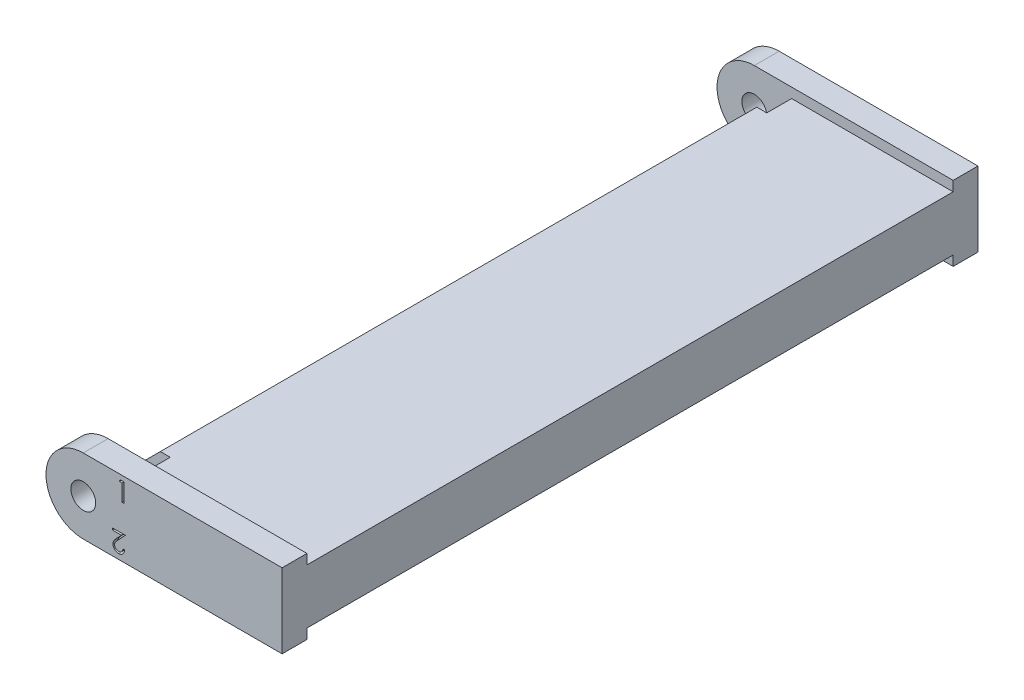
ISO-10303-21;
HEADER;
FILE_DESCRIPTION(('STEP AP214'),'2;1');
FILE_NAME('part.step','',(''),(''),'','','');
FILE_SCHEMA(('AUTOMOTIVE_DESIGN { 1 0 10303 214 1 1 1 1 }'));
ENDSEC;
DATA;
#1=APPLICATION_CONTEXT('core data for automotive mechanical design processes');
#2=APPLICATION_PROTOCOL_DEFINITION('international standard','automotive_design',2000,#1);
#3=PRODUCT_CONTEXT('',#1,'mechanical');
#4=PRODUCT('Part','Part','',(#3));
#5=PRODUCT_RELATED_PRODUCT_CATEGORY('part','',(#4));
#6=PRODUCT_DEFINITION_FORMATION('','',#4);
#7=PRODUCT_DEFINITION_CONTEXT('part definition',#1,'design');
#8=PRODUCT_DEFINITION('design','',#6,#7);
#9=PRODUCT_DEFINITION_SHAPE('','',#8);
#10=(LENGTH_UNIT() NAMED_UNIT(*) SI_UNIT(.MILLI.,.METRE.));
#11=(NAMED_UNIT(*) PLANE_ANGLE_UNIT() SI_UNIT($,.RADIAN.));
#12=(NAMED_UNIT(*) SI_UNIT($,.STERADIAN.) SOLID_ANGLE_UNIT());
#13=UNCERTAINTY_MEASURE_WITH_UNIT(LENGTH_MEASURE(1.E-05),#10,'distance_accuracy_value','');
#14=(GEOMETRIC_REPRESENTATION_CONTEXT(3) GLOBAL_UNCERTAINTY_ASSIGNED_CONTEXT((#13)) GLOBAL_UNIT_ASSIGNED_CONTEXT((#10,
#11,#12)) REPRESENTATION_CONTEXT('',''));
#15=CARTESIAN_POINT('',(0.,0.,0.));
#16=DIRECTION('',(0.,0.,1.));
#17=DIRECTION('',(1.,0.,0.));
#18=AXIS2_PLACEMENT_3D('',#15,#16,#17);
#19=CARTESIAN_POINT('',(76.2,0.,-342.9));
#20=DIRECTION('',(0.,0.,1.));
#21=DIRECTION('',(1.,0.,0.));
#22=AXIS2_PLACEMENT_3D('',#19,#20,#21);
#23=PLANE('',#22);
#24=DIRECTION('',(-0.496686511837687,0.867930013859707,0.));
#25=VECTOR('',#24,1.);
#26=CARTESIAN_POINT('',(-58.0376882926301,14.2228564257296,-342.9));
#27=LINE('',#26,#25);
#28=CARTESIAN_POINT('',(-58.0376882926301,14.2228564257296,-342.9));
#29=VERTEX_POINT('',#28);
#30=CARTESIAN_POINT('',(-58.5967477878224,15.1997795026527,-342.9));
#31=VERTEX_POINT('',#30);
#32=EDGE_CURVE('E57',#29,#31,#27,.T.);
#33=ORIENTED_EDGE('',*,*,#32,.T.);
#34=DIRECTION('',(-1.,0.,0.));
#35=VECTOR('',#34,1.);
#36=CARTESIAN_POINT('',(-58.5967477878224,15.1997795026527,-342.9));
#37=LINE('',#36,#35);
#38=CARTESIAN_POINT('',(-60.3578806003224,15.1997795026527,-342.9));
#39=VERTEX_POINT('',#38);
#40=EDGE_CURVE('E393',#31,#39,#37,.T.);
#41=ORIENTED_EDGE('',*,*,#40,.T.);
#42=DIRECTION('',(0.,-1.,0.));
#43=VECTOR('',#42,1.);
#44=CARTESIAN_POINT('',(-60.3578806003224,15.1997795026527,-342.9));
#45=LINE('',#44,#43);
#46=CARTESIAN_POINT('',(-60.3578806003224,5.67477950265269,-342.9));
#47=VERTEX_POINT('',#46);
#48=EDGE_CURVE('E416',#39,#47,#45,.T.);
#49=ORIENTED_EDGE('',*,*,#48,.T.);
#50=DIRECTION('',(1.,0.,0.));
#51=VECTOR('',#50,1.);
#52=CARTESIAN_POINT('',(-60.3578806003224,5.67477950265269,-342.9));
#53=LINE('',#52,#51);
#54=CARTESIAN_POINT('',(-59.5030729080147,5.67477950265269,-342.9));
#55=VERTEX_POINT('',#54);
#56=EDGE_CURVE('E419',#47,#55,#53,.T.);
#57=ORIENTED_EDGE('',*,*,#56,.T.);
#58=DIRECTION('',(0.,1.,0.));
#59=VECTOR('',#58,1.);
#60=CARTESIAN_POINT('',(-59.5030729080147,5.67477950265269,-342.9));
#61=LINE('',#60,#59);
#62=CARTESIAN_POINT('',(-59.5030729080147,14.2228564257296,-342.9));
#63=VERTEX_POINT('',#62);
#64=EDGE_CURVE('E422',#55,#63,#61,.T.);
#65=ORIENTED_EDGE('',*,*,#64,.T.);
#66=DIRECTION('',(1.,0.,0.));
#67=VECTOR('',#66,1.);
#68=CARTESIAN_POINT('',(-59.5030729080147,14.2228564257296,-342.9));
#69=LINE('',#68,#67);
#70=EDGE_CURVE('E403',#63,#29,#69,.T.);
#71=ORIENTED_EDGE('',*,*,#70,.T.);
#72=EDGE_LOOP('',(#33,#41,#49,#57,#65,#71));
#73=FACE_BOUND('',#72,.T.);
#74=CARTESIAN_POINT('',(-76.2,0.,-342.899999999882));
#75=DIRECTION('',(0.,0.,-1.));
#76=DIRECTION('',(-1.,0.,0.));
#77=AXIS2_PLACEMENT_3D('',#74,#75,#76);
#78=CIRCLE('',#77,6.35);
#79=CARTESIAN_POINT('',(-82.55,0.,-342.899999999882));
#80=VERTEX_POINT('',#79);
#81=EDGE_CURVE('E696',#80,#80,#78,.T.);
#82=ORIENTED_EDGE('',*,*,#81,.F.);
#83=EDGE_LOOP('',(#82));
#84=FACE_BOUND('',#83,.T.);
#85=DIRECTION('',(0.,1.,0.));
#86=VECTOR('',#85,1.);
#87=CARTESIAN_POINT('',(25.4,0.,-342.9));
#88=LINE('',#87,#86);
#89=CARTESIAN_POINT('',(25.4,-19.05,-342.9));
#90=VERTEX_POINT('',#89);
#91=CARTESIAN_POINT('',(25.4,19.05,-342.9));
#92=VERTEX_POINT('',#91);
#93=EDGE_CURVE('E11',#90,#92,#88,.T.);
#94=ORIENTED_EDGE('',*,*,#93,.F.);
#95=DIRECTION('',(-1.,0.,0.));
#96=VECTOR('',#95,1.);
#97=CARTESIAN_POINT('',(76.2,-19.05,-342.9));
#98=LINE('',#97,#96);
#99=CARTESIAN_POINT('',(-76.2,-19.05,-342.9));
#100=VERTEX_POINT('',#99);
#101=EDGE_CURVE('E633',#90,#100,#98,.T.);
#102=ORIENTED_EDGE('',*,*,#101,.T.);
#103=CARTESIAN_POINT('',(-76.2,0.,-342.9));
#104=DIRECTION('',(0.,0.,-1.));
#105=DIRECTION('',(1.,0.,0.));
#106=AXIS2_PLACEMENT_3D('',#103,#104,#105);
#107=CIRCLE('',#106,19.05);
#108=CARTESIAN_POINT('',(-76.2,19.05,-342.9));
#109=VERTEX_POINT('',#108);
#110=EDGE_CURVE('E635',#100,#109,#107,.T.);
#111=ORIENTED_EDGE('',*,*,#110,.T.);
#112=DIRECTION('',(1.,0.,0.));
#113=VECTOR('',#112,1.);
#114=CARTESIAN_POINT('',(76.2,19.05,-342.9));
#115=LINE('',#114,#113);
#116=EDGE_CURVE('E638',#109,#92,#115,.T.);
#117=ORIENTED_EDGE('',*,*,#116,.T.);
#118=EDGE_LOOP('',(#94,#102,#111,#117));
#119=FACE_BOUND('',#118,.T.);
#120=CARTESIAN_POINT('',(-58.7806507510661,-14.9885385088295,-342.9));
#121=CARTESIAN_POINT('',(-58.8551575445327,-14.9866699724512,-342.9));
#122=CARTESIAN_POINT('',(-59.0014765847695,-14.9830004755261,-342.9));
#123=CARTESIAN_POINT('',(-59.2158436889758,-14.9551887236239,-342.9));
#124=CARTESIAN_POINT('',(-59.4217742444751,-14.913069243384,-342.9));
#125=CARTESIAN_POINT('',(-59.6160949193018,-14.8460153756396,-342.9));
#126=CARTESIAN_POINT('',(-59.8028724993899,-14.7675375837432,-342.9));
#127=CARTESIAN_POINT('',(-59.9773421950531,-14.6659226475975,-342.9));
#128=CARTESIAN_POINT('',(-60.1444050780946,-14.5498118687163,-342.9));
#129=CARTESIAN_POINT('',(-60.3007022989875,-14.4144340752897,-342.9));
#130=CARTESIAN_POINT('',(-60.4430552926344,-14.2616129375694,-342.9));
#131=CARTESIAN_POINT('',(-60.5725550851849,-14.0952698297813,-342.9));
#132=CARTESIAN_POINT('',(-60.6822815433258,-13.9124558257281,-342.9));
#133=CARTESIAN_POINT('',(-60.7796846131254,-13.7175575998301,-342.9));
#134=CARTESIAN_POINT('',(-60.8541787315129,-13.5052204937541,-342.9));
#135=CARTESIAN_POINT('',(-60.9178658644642,-13.2806374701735,-342.9));
#136=CARTESIAN_POINT('',(-60.9641272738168,-13.040604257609,-342.9));
#137=CARTESIAN_POINT('',(-60.9800873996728,-12.8752273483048,-342.9));
#138=CARTESIAN_POINT('',(-60.9882679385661,-12.7904615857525,-342.9));
#139=B_SPLINE_CURVE_WITH_KNOTS('',3,(#120,#121,#122,#123,#124,#125,#126,#127,#128,#129,#130,
#131,#132,#133,#134,#135,#136,#137,#138),.UNSPECIFIED.,.F.,.F.,(4,1,1,1,1,1,1,1,1,1,1,1,1,1,1,1,
4),(0.,0.0644420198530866,0.126553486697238,0.186778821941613,0.245943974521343,
0.304110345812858,0.361785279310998,0.420255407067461,0.479942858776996,0.540286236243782,
0.60071235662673,0.661962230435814,0.724472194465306,0.788881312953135,0.856306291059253,
0.926348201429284,1.),.UNSPECIFIED.);
#140=CARTESIAN_POINT('',(-58.7806507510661,-14.9885385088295,-342.9));
#141=VERTEX_POINT('',#140);
#142=CARTESIAN_POINT('',(-60.9882679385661,-12.7904615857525,-342.9));
#143=VERTEX_POINT('',#142);
#144=EDGE_CURVE('E49',#141,#143,#139,.T.);
#145=ORIENTED_EDGE('',*,*,#144,.T.);
#146=DIRECTION('',(-1.,0.,0.));
#147=VECTOR('',#146,1.);
#148=CARTESIAN_POINT('',(-60.9882679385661,-12.7904615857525,-342.9));
#149=LINE('',#148,#147);
#150=CARTESIAN_POINT('',(-61.8430756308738,-12.7904615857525,-342.9));
#151=VERTEX_POINT('',#150);
#152=EDGE_CURVE('E390',#143,#151,#149,.T.);
#153=ORIENTED_EDGE('',*,*,#152,.T.);
#154=CARTESIAN_POINT('',(-61.8430756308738,-12.7904615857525,-342.9));
#155=CARTESIAN_POINT('',(-61.837505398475,-12.9038664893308,-342.9));
#156=CARTESIAN_POINT('',(-61.8265656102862,-13.1265907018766,-342.9));
#157=CARTESIAN_POINT('',(-61.7753123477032,-13.4513142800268,-342.9));
#158=CARTESIAN_POINT('',(-61.702043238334,-13.7617348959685,-342.9));
#159=CARTESIAN_POINT('',(-61.5982038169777,-14.0551912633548,-342.9));
#160=CARTESIAN_POINT('',(-61.4699712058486,-14.3351889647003,-342.9));
#161=CARTESIAN_POINT('',(-61.3129773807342,-14.5980099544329,-342.9));
#162=CARTESIAN_POINT('',(-61.130569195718,-14.8462626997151,-342.9));
#163=CARTESIAN_POINT('',(-60.9230812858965,-15.0752469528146,-342.9));
#164=CARTESIAN_POINT('',(-60.6979377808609,-15.2845671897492,-342.9));
#165=CARTESIAN_POINT('',(-60.4564876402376,-15.4672387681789,-342.9));
#166=CARTESIAN_POINT('',(-60.2012125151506,-15.6198125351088,-342.9));
#167=CARTESIAN_POINT('',(-59.9343265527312,-15.7480543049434,-342.9));
#168=CARTESIAN_POINT('',(-59.6527431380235,-15.8441984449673,-342.9));
#169=CARTESIAN_POINT('',(-59.3591538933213,-15.9155671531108,-342.9));
#170=CARTESIAN_POINT('',(-59.0522318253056,-15.958499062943,-342.9));
#171=CARTESIAN_POINT('',(-58.8431174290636,-15.9631143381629,-342.9));
#172=CARTESIAN_POINT('',(-58.73676553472,-15.9654615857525,-342.9));
#173=B_SPLINE_CURVE_WITH_KNOTS('',3,(#154,#155,#156,#157,#158,#159,#160,#161,#162,#163,#164,
#165,#166,#167,#168,#169,#170,#171,#172),.UNSPECIFIED.,.F.,.F.,(4,1,1,1,1,1,1,1,1,1,1,1,1,1,1,1,
4),(0.,0.0687985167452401,0.135118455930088,0.199001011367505,0.261933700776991,
0.323531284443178,0.385434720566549,0.447215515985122,0.510018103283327,0.572510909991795,
0.633364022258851,0.693216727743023,0.752555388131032,0.812558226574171,0.873260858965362,
0.935542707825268,1.),.UNSPECIFIED.);
#174=CARTESIAN_POINT('',(-58.73676553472,-15.9654615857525,-342.9));
#175=VERTEX_POINT('',#174);
#176=EDGE_CURVE('E1345',#151,#175,#173,.T.);
#177=ORIENTED_EDGE('',*,*,#176,.T.);
#178=CARTESIAN_POINT('',(-58.73676553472,-15.9654615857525,-342.9));
#179=CARTESIAN_POINT('',(-58.6323149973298,-15.9630363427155,-342.9));
#180=CARTESIAN_POINT('',(-58.4270734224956,-15.9582708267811,-342.9));
#181=CARTESIAN_POINT('',(-58.1276514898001,-15.9167304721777,-342.9));
#182=CARTESIAN_POINT('',(-57.8419311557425,-15.8530735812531,-342.9));
#183=CARTESIAN_POINT('',(-57.5731504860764,-15.758744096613,-342.9));
#184=CARTESIAN_POINT('',(-57.3185510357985,-15.6403812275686,-342.9));
#185=CARTESIAN_POINT('',(-57.0812851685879,-15.4931814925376,-342.9));
#186=CARTESIAN_POINT('',(-56.8556155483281,-15.3241098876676,-342.9));
#187=CARTESIAN_POINT('',(-56.6526176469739,-15.1246816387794,-342.9));
#188=CARTESIAN_POINT('',(-56.4661395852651,-14.9118911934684,-342.9));
#189=CARTESIAN_POINT('',(-56.305406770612,-14.6846327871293,-342.9));
#190=CARTESIAN_POINT('',(-56.1669824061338,-14.4496405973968,-342.9));
#191=CARTESIAN_POINT('',(-56.0536863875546,-14.2050789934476,-342.9));
#192=CARTESIAN_POINT('',(-55.9678029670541,-13.9501515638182,-342.9));
#193=CARTESIAN_POINT('',(-55.9041715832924,-13.6873023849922,-342.9));
#194=CARTESIAN_POINT('',(-55.867796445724,-13.4134979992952,-342.9));
#195=CARTESIAN_POINT('',(-55.8622444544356,-13.2281455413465,-342.9));
#196=CARTESIAN_POINT('',(-55.85942178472,-13.1339111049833,-342.9));
#197=B_SPLINE_CURVE_WITH_KNOTS('',3,(#178,#179,#180,#181,#182,#183,#184,#185,#186,#187,#188,
#189,#190,#191,#192,#193,#194,#195,#196),.UNSPECIFIED.,.F.,.F.,(4,1,1,1,1,1,1,1,1,1,1,1,1,1,1,1,
4),(0.,0.069479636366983,0.136525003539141,0.200800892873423,0.263983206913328,
0.325711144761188,0.387270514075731,0.449492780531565,0.51295519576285,0.576266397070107,
0.637574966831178,0.697901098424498,0.757558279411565,0.816587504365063,0.876645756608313,
0.937285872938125,1.),.UNSPECIFIED.);
#198=CARTESIAN_POINT('',(-55.85942178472,-13.1339111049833,-342.9));
#199=VERTEX_POINT('',#198);
#200=EDGE_CURVE('E1350',#175,#199,#197,.T.);
#201=ORIENTED_EDGE('',*,*,#200,.T.);
#202=CARTESIAN_POINT('',(-55.85942178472,-13.1339111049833,-342.9));
#203=CARTESIAN_POINT('',(-55.8640299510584,-13.0012474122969,-342.9));
#204=CARTESIAN_POINT('',(-55.8731654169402,-12.7382480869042,-342.9));
#205=CARTESIAN_POINT('',(-55.9513084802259,-12.3517639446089,-342.9));
#206=CARTESIAN_POINT('',(-56.0733590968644,-11.9773164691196,-342.9));
#207=CARTESIAN_POINT('',(-56.2202960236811,-11.6759425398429,-342.9));
#208=CARTESIAN_POINT('',(-56.368568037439,-11.433122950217,-342.9));
#209=CARTESIAN_POINT('',(-56.5020490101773,-11.2330985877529,-342.9));
#210=CARTESIAN_POINT('',(-56.6591992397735,-11.0177828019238,-342.9));
#211=CARTESIAN_POINT('',(-56.8386761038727,-10.7863041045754,-342.9));
#212=CARTESIAN_POINT('',(-57.0435704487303,-10.5416939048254,-342.9));
#213=CARTESIAN_POINT('',(-57.2685591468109,-10.2789614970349,-342.9));
#214=CARTESIAN_POINT('',(-57.5194526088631,-10.0029649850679,-342.9));
#215=CARTESIAN_POINT('',(-57.6953892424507,-9.81433284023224,-342.9));
#216=CARTESIAN_POINT('',(-57.7865551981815,-9.71658838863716,-342.9));
#217=B_SPLINE_CURVE_WITH_KNOTS('',3,(#202,#203,#204,#205,#206,#207,#208,#209,#210,#211,#212,
#213,#214,#215,#216),.UNSPECIFIED.,.F.,.F.,(4,1,1,1,1,1,1,1,1,1,1,1,4),(0.,0.0987013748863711,
0.195670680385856,0.292419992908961,0.391339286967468,0.444458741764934,0.504224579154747,
0.570347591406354,0.642913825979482,0.722289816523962,0.80792272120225,0.900470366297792,1.),.UNSPECIFIED.);
#218=CARTESIAN_POINT('',(-57.7865551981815,-9.71658838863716,-342.9));
#219=VERTEX_POINT('',#218);
#220=EDGE_CURVE('E1358',#199,#219,#217,.T.);
#221=ORIENTED_EDGE('',*,*,#220,.T.);
#222=DIRECTION('',(-0.683740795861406,0.729724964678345,0.));
#223=VECTOR('',#222,1.);
#224=CARTESIAN_POINT('',(-57.7865551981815,-9.71658838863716,-342.9));
#225=LINE('',#224,#223);
#226=CARTESIAN_POINT('',(-60.1697132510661,-7.17315389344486,-342.9));
#227=VERTEX_POINT('',#226);
#228=EDGE_CURVE('E1366',#219,#227,#225,.T.);
#229=ORIENTED_EDGE('',*,*,#228,.T.);
#230=DIRECTION('',(1.,0.,0.));
#231=VECTOR('',#230,1.);
#232=CARTESIAN_POINT('',(-60.1697132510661,-7.17315389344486,-342.9));
#233=LINE('',#232,#231);
#234=CARTESIAN_POINT('',(-55.7373064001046,-7.17315389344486,-342.9));
#235=VERTEX_POINT('',#234);
#236=EDGE_CURVE('E1372',#227,#235,#233,.T.);
#237=ORIENTED_EDGE('',*,*,#236,.T.);
#238=DIRECTION('',(0.,1.,0.));
#239=VECTOR('',#238,1.);
#240=CARTESIAN_POINT('',(-55.7373064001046,-7.17315389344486,-342.9));
#241=LINE('',#240,#239);
#242=CARTESIAN_POINT('',(-55.7373064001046,-6.19623081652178,-342.9));
#243=VERTEX_POINT('',#242);
#244=EDGE_CURVE('E1375',#235,#243,#241,.T.);
#245=ORIENTED_EDGE('',*,*,#244,.T.);
#246=DIRECTION('',(-1.,0.,0.));
#247=VECTOR('',#246,1.);
#248=CARTESIAN_POINT('',(-55.7373064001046,-6.19623081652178,-342.9));
#249=LINE('',#248,#247);
#250=CARTESIAN_POINT('',(-62.20942178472,-6.19623081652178,-342.9));
#251=VERTEX_POINT('',#250);
#252=EDGE_CURVE('E1378',#243,#251,#249,.T.);
#253=ORIENTED_EDGE('',*,*,#252,.T.);
#254=DIRECTION('',(0.683776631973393,-0.729691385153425,0.));
#255=VECTOR('',#254,1.);
#256=CARTESIAN_POINT('',(-62.20942178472,-6.19623081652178,-342.9));
#257=LINE('',#256,#255);
#258=CARTESIAN_POINT('',(-58.5154314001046,-10.1382680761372,-342.9));
#259=VERTEX_POINT('',#258);
#260=EDGE_CURVE('E1381',#251,#259,#257,.T.);
#261=ORIENTED_EDGE('',*,*,#260,.T.);
#262=CARTESIAN_POINT('',(-58.5154314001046,-10.1382680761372,-342.9));
#263=CARTESIAN_POINT('',(-58.4254875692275,-10.2321476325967,-342.9));
#264=CARTESIAN_POINT('',(-58.2527238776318,-10.4124710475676,-342.9));
#265=CARTESIAN_POINT('',(-58.0084707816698,-10.6758174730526,-342.9));
#266=CARTESIAN_POINT('',(-57.7887393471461,-10.9198407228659,-342.9));
#267=CARTESIAN_POINT('',(-57.5933838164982,-11.1456221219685,-342.9));
#268=CARTESIAN_POINT('',(-57.4222434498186,-11.3518817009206,-342.9));
#269=CARTESIAN_POINT('',(-57.2758658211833,-11.5402358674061,-342.9));
#270=CARTESIAN_POINT('',(-57.1536039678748,-11.7090682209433,-342.9));
#271=CARTESIAN_POINT('',(-57.0240318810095,-11.9074054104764,-342.9));
#272=CARTESIAN_POINT('',(-56.9004762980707,-12.1498507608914,-342.9));
#273=CARTESIAN_POINT('',(-56.791883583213,-12.4446413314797,-342.9));
#274=CARTESIAN_POINT('',(-56.7261430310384,-12.7487761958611,-342.9));
#275=CARTESIAN_POINT('',(-56.7182165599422,-12.9542392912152,-342.9));
#276=CARTESIAN_POINT('',(-56.7142294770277,-13.0575889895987,-342.9));
#277=B_SPLINE_CURVE_WITH_KNOTS('',3,(#262,#263,#264,#265,#266,#267,#268,#269,#270,#271,#272,
#273,#274,#275,#276),.UNSPECIFIED.,.F.,.F.,(4,1,1,1,1,1,1,1,1,1,1,1,4),(0.,0.110794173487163,
0.212812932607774,0.306077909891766,0.390617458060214,0.467232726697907,0.534450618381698,
0.59386680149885,0.644832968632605,0.736220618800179,0.825037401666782,0.911992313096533,1.),.UNSPECIFIED.);
#278=CARTESIAN_POINT('',(-56.7142294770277,-13.0575889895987,-342.9));
#279=VERTEX_POINT('',#278);
#280=EDGE_CURVE('E1384',#259,#279,#277,.T.);
#281=ORIENTED_EDGE('',*,*,#280,.T.);
#282=CARTESIAN_POINT('',(-56.7142294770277,-13.0575889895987,-342.9));
#283=CARTESIAN_POINT('',(-56.7159418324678,-13.12258769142,-342.9));
#284=CARTESIAN_POINT('',(-56.7193165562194,-13.2506876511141,-342.9));
#285=CARTESIAN_POINT('',(-56.7496642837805,-13.4383788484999,-342.9));
#286=CARTESIAN_POINT('',(-56.794251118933,-13.6201308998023,-342.9));
#287=CARTESIAN_POINT('',(-56.8629732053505,-13.7936965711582,-342.9));
#288=CARTESIAN_POINT('',(-56.9455402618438,-13.962489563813,-342.9));
#289=CARTESIAN_POINT('',(-57.0510257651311,-14.1213780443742,-342.9));
#290=CARTESIAN_POINT('',(-57.171567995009,-14.2757781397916,-342.9));
#291=CARTESIAN_POINT('',(-57.3113910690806,-14.4203955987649,-342.9));
#292=CARTESIAN_POINT('',(-57.4648908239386,-14.5528876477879,-342.9));
#293=CARTESIAN_POINT('',(-57.6270775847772,-14.6702442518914,-342.9));
#294=CARTESIAN_POINT('',(-57.7986625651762,-14.7683227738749,-342.9));
#295=CARTESIAN_POINT('',(-57.978930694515,-14.8487231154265,-342.9));
#296=CARTESIAN_POINT('',(-58.1673771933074,-14.9117933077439,-342.9));
#297=CARTESIAN_POINT('',(-58.3643671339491,-14.9554955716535,-342.9));
#298=CARTESIAN_POINT('',(-58.5693560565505,-14.9829343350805,-342.9));
#299=CARTESIAN_POINT('',(-58.7093286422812,-14.9866468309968,-342.9));
#300=CARTESIAN_POINT('',(-58.7806507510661,-14.9885385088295,-342.9));
#301=B_SPLINE_CURVE_WITH_KNOTS('',3,(#282,#283,#284,#285,#286,#287,#288,#289,#290,#291,#292,
#293,#294,#295,#296,#297,#298,#299,#300),.UNSPECIFIED.,.F.,.F.,(4,1,1,1,1,1,1,1,1,1,1,1,1,1,1,1,
4),(0.,0.0619690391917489,0.122129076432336,0.180999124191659,0.240162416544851,
0.299864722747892,0.359951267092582,0.421741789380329,0.486545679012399,0.551508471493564,
0.614994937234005,0.677239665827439,0.739714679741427,0.803038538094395,0.866487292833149,
0.931969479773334,1.),.UNSPECIFIED.);
#302=EDGE_CURVE('E386',#279,#141,#301,.T.);
#303=ORIENTED_EDGE('',*,*,#302,.T.);
#304=EDGE_LOOP('',(#145,#153,#177,#201,#221,#229,#237,#245,#253,#261,#281,#303));
#305=FACE_BOUND('',#304,.T.);
#306=ADVANCED_FACE('F34',(#73,#84,#119,#305),#23,.F.);
#307=CARTESIAN_POINT('',(-76.2,0.,12.7));
#308=DIRECTION('',(0.,0.,-1.));
#309=DIRECTION('',(-1.,0.,0.));
#310=AXIS2_PLACEMENT_3D('',#307,#308,#309);
#311=PLANE('',#310);
#312=DIRECTION('',(0.496686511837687,0.867930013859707,0.));
#313=VECTOR('',#312,1.);
#314=CARTESIAN_POINT('',(-57.7947941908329,15.6788108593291,12.7));
#315=LINE('',#314,#313);
#316=CARTESIAN_POINT('',(-57.7947941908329,15.6788108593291,12.7));
#317=VERTEX_POINT('',#316);
#318=CARTESIAN_POINT('',(-57.2357346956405,16.6557339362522,12.7));
#319=VERTEX_POINT('',#318);
#320=EDGE_CURVE('E771',#317,#319,#315,.T.);
#321=ORIENTED_EDGE('',*,*,#320,.T.);
#322=DIRECTION('',(1.,0.,0.));
#323=VECTOR('',#322,1.);
#324=CARTESIAN_POINT('',(-57.2357346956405,16.6557339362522,12.7));
#325=LINE('',#324,#323);
#326=CARTESIAN_POINT('',(-55.4746018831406,16.6557339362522,12.7));
#327=VERTEX_POINT('',#326);
#328=EDGE_CURVE('E768',#319,#327,#325,.T.);
#329=ORIENTED_EDGE('',*,*,#328,.T.);
#330=DIRECTION('',(0.,-1.,0.));
#331=VECTOR('',#330,1.);
#332=CARTESIAN_POINT('',(-55.4746018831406,16.6557339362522,12.7));
#333=LINE('',#332,#331);
#334=CARTESIAN_POINT('',(-55.4746018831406,7.1307339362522,12.7));
#335=VERTEX_POINT('',#334);
#336=EDGE_CURVE('E765',#327,#335,#333,.T.);
#337=ORIENTED_EDGE('',*,*,#336,.T.);
#338=DIRECTION('',(-1.,0.,0.));
#339=VECTOR('',#338,1.);
#340=CARTESIAN_POINT('',(-55.4746018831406,7.1307339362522,12.7));
#341=LINE('',#340,#339);
#342=CARTESIAN_POINT('',(-56.3294095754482,7.1307339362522,12.7));
#343=VERTEX_POINT('',#342);
#344=EDGE_CURVE('E762',#335,#343,#341,.T.);
#345=ORIENTED_EDGE('',*,*,#344,.T.);
#346=DIRECTION('',(0.,1.,0.));
#347=VECTOR('',#346,1.);
#348=CARTESIAN_POINT('',(-56.3294095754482,7.1307339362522,12.7));
#349=LINE('',#348,#347);
#350=CARTESIAN_POINT('',(-56.3294095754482,15.6788108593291,12.7));
#351=VERTEX_POINT('',#350);
#352=EDGE_CURVE('E759',#343,#351,#349,.T.);
#353=ORIENTED_EDGE('',*,*,#352,.T.);
#354=DIRECTION('',(-1.,0.,0.));
#355=VECTOR('',#354,1.);
#356=CARTESIAN_POINT('',(-56.3294095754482,15.6788108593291,12.7));
#357=LINE('',#356,#355);
#358=EDGE_CURVE('E755',#351,#317,#357,.T.);
#359=ORIENTED_EDGE('',*,*,#358,.T.);
#360=EDGE_LOOP('',(#321,#329,#337,#345,#353,#359));
#361=FACE_BOUND('',#360,.T.);
#362=CARTESIAN_POINT('',(-76.2,0.,12.7));
#363=DIRECTION('',(0.,0.,1.));
#364=DIRECTION('',(1.,0.,0.));
#365=AXIS2_PLACEMENT_3D('',#362,#363,#364);
#366=CIRCLE('',#365,6.35);
#367=CARTESIAN_POINT('',(-69.85,0.,12.7));
#368=VERTEX_POINT('',#367);
#369=EDGE_CURVE('E702',#368,#368,#366,.T.);
#370=ORIENTED_EDGE('',*,*,#369,.F.);
#371=EDGE_LOOP('',(#370));
#372=FACE_BOUND('',#371,.T.);
#373=DIRECTION('',(0.,-1.,0.));
#374=VECTOR('',#373,1.);
#375=CARTESIAN_POINT('',(25.4,0.,12.7));
#376=LINE('',#375,#374);
#377=CARTESIAN_POINT('',(25.4,19.05,12.7));
#378=VERTEX_POINT('',#377);
#379=CARTESIAN_POINT('',(25.4,-19.05,12.7));
#380=VERTEX_POINT('',#379);
#381=EDGE_CURVE('E686',#378,#380,#376,.T.);
#382=ORIENTED_EDGE('',*,*,#381,.F.);
#383=DIRECTION('',(-1.,0.,0.));
#384=VECTOR('',#383,1.);
#385=CARTESIAN_POINT('',(-76.2,19.05,12.7));
#386=LINE('',#385,#384);
#387=CARTESIAN_POINT('',(-76.2,19.05,12.7));
#388=VERTEX_POINT('',#387);
#389=EDGE_CURVE('E667',#378,#388,#386,.T.);
#390=ORIENTED_EDGE('',*,*,#389,.T.);
#391=CARTESIAN_POINT('',(-76.2,0.,12.7));
#392=DIRECTION('',(0.,0.,1.));
#393=DIRECTION('',(-1.,0.,0.));
#394=AXIS2_PLACEMENT_3D('',#391,#392,#393);
#395=CIRCLE('',#394,19.05);
#396=CARTESIAN_POINT('',(-76.2,-19.05,12.7));
#397=VERTEX_POINT('',#396);
#398=EDGE_CURVE('E660',#388,#397,#395,.T.);
#399=ORIENTED_EDGE('',*,*,#398,.T.);
#400=DIRECTION('',(1.,0.,0.));
#401=VECTOR('',#400,1.);
#402=CARTESIAN_POINT('',(-76.2,-19.05,12.7));
#403=LINE('',#402,#401);
#404=EDGE_CURVE('E663',#397,#380,#403,.T.);
#405=ORIENTED_EDGE('',*,*,#404,.T.);
#406=EDGE_LOOP('',(#382,#390,#399,#405));
#407=FACE_BOUND('',#406,.T.);
#408=CARTESIAN_POINT('',(-58.1190852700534,-15.422843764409,12.7));
#409=CARTESIAN_POINT('',(-58.0445784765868,-15.4209752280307,12.7));
#410=CARTESIAN_POINT('',(-57.89825943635,-15.4173057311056,12.7));
#411=CARTESIAN_POINT('',(-57.6838923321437,-15.3894939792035,12.7));
#412=CARTESIAN_POINT('',(-57.4779617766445,-15.3473744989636,12.7));
#413=CARTESIAN_POINT('',(-57.2836411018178,-15.2803206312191,12.7));
#414=CARTESIAN_POINT('',(-57.0968635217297,-15.2018428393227,12.7));
#415=CARTESIAN_POINT('',(-56.9223938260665,-15.100227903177,12.7));
#416=CARTESIAN_POINT('',(-56.7553309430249,-14.9841171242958,12.7));
#417=CARTESIAN_POINT('',(-56.599033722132,-14.8487393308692,12.7));
#418=CARTESIAN_POINT('',(-56.4566807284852,-14.6959181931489,12.7));
#419=CARTESIAN_POINT('',(-56.3271809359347,-14.5295750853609,12.7));
#420=CARTESIAN_POINT('',(-56.2174544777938,-14.3467610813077,12.7));
#421=CARTESIAN_POINT('',(-56.1200514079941,-14.1518628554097,12.7));
#422=CARTESIAN_POINT('',(-56.0455572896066,-13.9395257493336,12.7));
#423=CARTESIAN_POINT('',(-55.9818701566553,-13.714942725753,12.7));
#424=CARTESIAN_POINT('',(-55.9356087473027,-13.4749095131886,12.7));
#425=CARTESIAN_POINT('',(-55.9196486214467,-13.3095326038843,12.7));
#426=CARTESIAN_POINT('',(-55.9114680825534,-13.2247668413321,12.7));
#427=B_SPLINE_CURVE_WITH_KNOTS('',3,(#408,#409,#410,#411,#412,#413,#414,#415,#416,#417,#418,
#419,#420,#421,#422,#423,#424,#425,#426),.UNSPECIFIED.,.F.,.F.,(4,1,1,1,1,1,1,1,1,1,1,1,1,1,1,1,
4),(0.,0.0644420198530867,0.126553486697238,0.186778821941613,0.245943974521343,
0.304110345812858,0.361785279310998,0.42025540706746,0.479942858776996,0.540286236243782,
0.60071235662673,0.661962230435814,0.724472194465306,0.788881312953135,0.856306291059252,
0.926348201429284,1.),.UNSPECIFIED.);
#428=CARTESIAN_POINT('',(-58.1190852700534,-15.422843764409,12.7));
#429=VERTEX_POINT('',#428);
#430=CARTESIAN_POINT('',(-55.9114680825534,-13.2247668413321,12.7));
#431=VERTEX_POINT('',#430);
#432=EDGE_CURVE('E438',#429,#431,#427,.T.);
#433=ORIENTED_EDGE('',*,*,#432,.T.);
#434=DIRECTION('',(1.,0.,0.));
#435=VECTOR('',#434,1.);
#436=CARTESIAN_POINT('',(-55.9114680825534,-13.2247668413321,12.7));
#437=LINE('',#436,#435);
#438=CARTESIAN_POINT('',(-55.0566603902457,-13.2247668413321,12.7));
#439=VERTEX_POINT('',#438);
#440=EDGE_CURVE('E863',#431,#439,#437,.T.);
#441=ORIENTED_EDGE('',*,*,#440,.T.);
#442=CARTESIAN_POINT('',(-55.0566603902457,-13.2247668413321,12.7));
#443=CARTESIAN_POINT('',(-55.0622306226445,-13.3381717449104,12.7));
#444=CARTESIAN_POINT('',(-55.0731704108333,-13.5608959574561,12.7));
#445=CARTESIAN_POINT('',(-55.1244236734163,-13.8856195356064,12.7));
#446=CARTESIAN_POINT('',(-55.1976927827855,-14.1960401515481,12.7));
#447=CARTESIAN_POINT('',(-55.3015322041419,-14.4894965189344,12.7));
#448=CARTESIAN_POINT('',(-55.429764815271,-14.7694942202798,12.7));
#449=CARTESIAN_POINT('',(-55.5867586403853,-15.0323152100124,12.7));
#450=CARTESIAN_POINT('',(-55.7691668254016,-15.2805679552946,12.7));
#451=CARTESIAN_POINT('',(-55.976654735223,-15.5095522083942,12.7));
#452=CARTESIAN_POINT('',(-56.2017982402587,-15.7188724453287,12.7));
#453=CARTESIAN_POINT('',(-56.443248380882,-15.9015440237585,12.7));
#454=CARTESIAN_POINT('',(-56.698523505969,-16.0541177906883,12.7));
#455=CARTESIAN_POINT('',(-56.9654094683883,-16.1823595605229,12.7));
#456=CARTESIAN_POINT('',(-57.2469928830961,-16.2785037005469,12.7));
#457=CARTESIAN_POINT('',(-57.5405821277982,-16.3498724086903,12.7));
#458=CARTESIAN_POINT('',(-57.8475041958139,-16.3928043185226,12.7));
#459=CARTESIAN_POINT('',(-58.0566185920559,-16.3974195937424,12.7));
#460=CARTESIAN_POINT('',(-58.1629704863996,-16.3997668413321,12.7));
#461=B_SPLINE_CURVE_WITH_KNOTS('',3,(#442,#443,#444,#445,#446,#447,#448,#449,#450,#451,#452,
#453,#454,#455,#456,#457,#458,#459,#460),.UNSPECIFIED.,.F.,.F.,(4,1,1,1,1,1,1,1,1,1,1,1,1,1,1,1,
4),(0.,0.0687985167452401,0.135118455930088,0.199001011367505,0.261933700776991,
0.323531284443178,0.385434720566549,0.447215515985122,0.510018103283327,0.572510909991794,
0.633364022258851,0.693216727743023,0.752555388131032,0.812558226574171,0.873260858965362,
0.935542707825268,1.),.UNSPECIFIED.);
#462=CARTESIAN_POINT('',(-58.1629704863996,-16.3997668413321,12.7));
#463=VERTEX_POINT('',#462);
#464=EDGE_CURVE('E855',#439,#463,#461,.T.);
#465=ORIENTED_EDGE('',*,*,#464,.T.);
#466=CARTESIAN_POINT('',(-58.1629704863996,-16.3997668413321,12.7));
#467=CARTESIAN_POINT('',(-58.2674210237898,-16.397341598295,12.7));
#468=CARTESIAN_POINT('',(-58.472662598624,-16.3925760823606,12.7));
#469=CARTESIAN_POINT('',(-58.7720845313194,-16.3510357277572,12.7));
#470=CARTESIAN_POINT('',(-59.0578048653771,-16.2873788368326,12.7));
#471=CARTESIAN_POINT('',(-59.3265855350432,-16.1930493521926,12.7));
#472=CARTESIAN_POINT('',(-59.5811849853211,-16.0746864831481,12.7));
#473=CARTESIAN_POINT('',(-59.8184508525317,-15.9274867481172,12.7));
#474=CARTESIAN_POINT('',(-60.0441204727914,-15.7584151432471,12.7));
#475=CARTESIAN_POINT('',(-60.2471183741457,-15.558986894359,12.7));
#476=CARTESIAN_POINT('',(-60.4335964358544,-15.3461964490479,12.7));
#477=CARTESIAN_POINT('',(-60.5943292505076,-15.1189380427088,12.7));
#478=CARTESIAN_POINT('',(-60.7327536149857,-14.8839458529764,12.7));
#479=CARTESIAN_POINT('',(-60.8460496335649,-14.6393842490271,12.7));
#480=CARTESIAN_POINT('',(-60.9319330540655,-14.3844568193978,12.7));
#481=CARTESIAN_POINT('',(-60.9955644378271,-14.1216076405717,12.7));
#482=CARTESIAN_POINT('',(-61.0319395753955,-13.8478032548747,12.7));
#483=CARTESIAN_POINT('',(-61.037491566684,-13.6624507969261,12.7));
#484=CARTESIAN_POINT('',(-61.0403142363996,-13.5682163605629,12.7));
#485=B_SPLINE_CURVE_WITH_KNOTS('',3,(#466,#467,#468,#469,#470,#471,#472,#473,#474,#475,#476,
#477,#478,#479,#480,#481,#482,#483,#484),.UNSPECIFIED.,.F.,.F.,(4,1,1,1,1,1,1,1,1,1,1,1,1,1,1,1,
4),(0.,0.069479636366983,0.136525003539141,0.200800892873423,0.263983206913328,
0.325711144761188,0.387270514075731,0.449492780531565,0.51295519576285,0.576266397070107,
0.637574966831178,0.697901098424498,0.757558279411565,0.816587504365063,0.876645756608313,
0.937285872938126,1.),.UNSPECIFIED.);
#486=CARTESIAN_POINT('',(-61.0403142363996,-13.5682163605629,12.7));
#487=VERTEX_POINT('',#486);
#488=EDGE_CURVE('E847',#463,#487,#485,.T.);
#489=ORIENTED_EDGE('',*,*,#488,.T.);
#490=CARTESIAN_POINT('',(-61.0403142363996,-13.5682163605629,12.7));
#491=CARTESIAN_POINT('',(-61.0357060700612,-13.4355526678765,12.7));
#492=CARTESIAN_POINT('',(-61.0265706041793,-13.1725533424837,12.7));
#493=CARTESIAN_POINT('',(-60.9484275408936,-12.7860692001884,12.7));
#494=CARTESIAN_POINT('',(-60.8263769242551,-12.4116217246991,12.7));
#495=CARTESIAN_POINT('',(-60.6794399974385,-12.1102477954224,12.7));
#496=CARTESIAN_POINT('',(-60.5311679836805,-11.8674282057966,12.7));
#497=CARTESIAN_POINT('',(-60.3976870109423,-11.6674038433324,12.7));
#498=CARTESIAN_POINT('',(-60.240536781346,-11.4520880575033,12.7));
#499=CARTESIAN_POINT('',(-60.0610599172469,-11.220609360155,12.7));
#500=CARTESIAN_POINT('',(-59.8561655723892,-10.9759991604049,12.7));
#501=CARTESIAN_POINT('',(-59.6311768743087,-10.7132667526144,12.7));
#502=CARTESIAN_POINT('',(-59.3802834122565,-10.4372702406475,12.7));
#503=CARTESIAN_POINT('',(-59.2043467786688,-10.2486380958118,12.7));
#504=CARTESIAN_POINT('',(-59.113180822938,-10.1508936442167,12.7));
#505=B_SPLINE_CURVE_WITH_KNOTS('',3,(#490,#491,#492,#493,#494,#495,#496,#497,#498,#499,#500,
#501,#502,#503,#504),.UNSPECIFIED.,.F.,.F.,(4,1,1,1,1,1,1,1,1,1,1,1,4),(0.,0.0987013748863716,
0.195670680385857,0.292419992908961,0.391339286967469,0.444458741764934,0.504224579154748,
0.570347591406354,0.642913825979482,0.722289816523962,0.807922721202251,0.900470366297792,1.),.UNSPECIFIED.);
#506=CARTESIAN_POINT('',(-59.113180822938,-10.1508936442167,12.7));
#507=VERTEX_POINT('',#506);
#508=EDGE_CURVE('E842',#487,#507,#505,.T.);
#509=ORIENTED_EDGE('',*,*,#508,.T.);
#510=DIRECTION('',(0.683740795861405,0.729724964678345,0.));
#511=VECTOR('',#510,1.);
#512=CARTESIAN_POINT('',(-59.113180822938,-10.1508936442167,12.7));
#513=LINE('',#512,#511);
#514=CARTESIAN_POINT('',(-56.7300227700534,-7.6074591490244,12.7));
#515=VERTEX_POINT('',#514);
#516=EDGE_CURVE('E839',#507,#515,#513,.T.);
#517=ORIENTED_EDGE('',*,*,#516,.T.);
#518=DIRECTION('',(-1.,0.,0.));
#519=VECTOR('',#518,1.);
#520=CARTESIAN_POINT('',(-56.7300227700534,-7.6074591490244,12.7));
#521=LINE('',#520,#519);
#522=CARTESIAN_POINT('',(-61.1624296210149,-7.6074591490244,12.7));
#523=VERTEX_POINT('',#522);
#524=EDGE_CURVE('E836',#515,#523,#521,.T.);
#525=ORIENTED_EDGE('',*,*,#524,.T.);
#526=DIRECTION('',(0.,1.,0.));
#527=VECTOR('',#526,1.);
#528=CARTESIAN_POINT('',(-61.1624296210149,-7.6074591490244,12.7));
#529=LINE('',#528,#527);
#530=CARTESIAN_POINT('',(-61.1624296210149,-6.63053607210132,12.7));
#531=VERTEX_POINT('',#530);
#532=EDGE_CURVE('E833',#523,#531,#529,.T.);
#533=ORIENTED_EDGE('',*,*,#532,.T.);
#534=DIRECTION('',(1.,0.,0.));
#535=VECTOR('',#534,1.);
#536=CARTESIAN_POINT('',(-61.1624296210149,-6.63053607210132,12.7));
#537=LINE('',#536,#535);
#538=CARTESIAN_POINT('',(-54.6903142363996,-6.63053607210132,12.7));
#539=VERTEX_POINT('',#538);
#540=EDGE_CURVE('E830',#531,#539,#537,.T.);
#541=ORIENTED_EDGE('',*,*,#540,.T.);
#542=DIRECTION('',(-0.683776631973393,-0.729691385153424,0.));
#543=VECTOR('',#542,1.);
#544=CARTESIAN_POINT('',(-54.6903142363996,-6.63053607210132,12.7));
#545=LINE('',#544,#543);
#546=CARTESIAN_POINT('',(-58.3843046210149,-10.5725733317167,12.7));
#547=VERTEX_POINT('',#546);
#548=EDGE_CURVE('E824',#539,#547,#545,.T.);
#549=ORIENTED_EDGE('',*,*,#548,.T.);
#550=CARTESIAN_POINT('',(-58.3843046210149,-10.5725733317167,12.7));
#551=CARTESIAN_POINT('',(-58.474248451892,-10.6664528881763,12.7));
#552=CARTESIAN_POINT('',(-58.6470121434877,-10.8467763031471,12.7));
#553=CARTESIAN_POINT('',(-58.8912652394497,-11.1101227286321,12.7));
#554=CARTESIAN_POINT('',(-59.1109966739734,-11.3541459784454,12.7));
#555=CARTESIAN_POINT('',(-59.3063522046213,-11.5799273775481,12.7));
#556=CARTESIAN_POINT('',(-59.477492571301,-11.7861869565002,12.7));
#557=CARTESIAN_POINT('',(-59.6238701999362,-11.9745411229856,12.7));
#558=CARTESIAN_POINT('',(-59.7461320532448,-12.1433734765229,12.7));
#559=CARTESIAN_POINT('',(-59.87570414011,-12.3417106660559,12.7));
#560=CARTESIAN_POINT('',(-59.9992597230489,-12.5841560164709,12.7));
#561=CARTESIAN_POINT('',(-60.1078524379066,-12.8789465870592,12.7));
#562=CARTESIAN_POINT('',(-60.1735929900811,-13.1830814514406,12.7));
#563=CARTESIAN_POINT('',(-60.1815194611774,-13.3885445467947,12.7));
#564=CARTESIAN_POINT('',(-60.1855065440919,-13.4918942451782,12.7));
#565=B_SPLINE_CURVE_WITH_KNOTS('',3,(#550,#551,#552,#553,#554,#555,#556,#557,#558,#559,#560,
#561,#562,#563,#564),.UNSPECIFIED.,.F.,.F.,(4,1,1,1,1,1,1,1,1,1,1,1,4),(0.,0.110794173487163,
0.212812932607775,0.306077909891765,0.390617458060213,0.467232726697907,0.534450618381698,
0.59386680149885,0.644832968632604,0.736220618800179,0.825037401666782,0.911992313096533,1.),.UNSPECIFIED.);
#566=CARTESIAN_POINT('',(-60.1855065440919,-13.4918942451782,12.7));
#567=VERTEX_POINT('',#566);
#568=EDGE_CURVE('E816',#547,#567,#565,.T.);
#569=ORIENTED_EDGE('',*,*,#568,.T.);
#570=CARTESIAN_POINT('',(-60.1855065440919,-13.4918942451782,12.7));
#571=CARTESIAN_POINT('',(-60.1837941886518,-13.5568929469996,12.7));
#572=CARTESIAN_POINT('',(-60.1804194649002,-13.6849929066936,12.7));
#573=CARTESIAN_POINT('',(-60.150071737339,-13.8726841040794,12.7));
#574=CARTESIAN_POINT('',(-60.1054849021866,-14.0544361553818,12.7));
#575=CARTESIAN_POINT('',(-60.036762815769,-14.2280018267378,12.7));
#576=CARTESIAN_POINT('',(-59.9541957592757,-14.3967948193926,12.7));
#577=CARTESIAN_POINT('',(-59.8487102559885,-14.5556832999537,12.7));
#578=CARTESIAN_POINT('',(-59.7281680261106,-14.7100833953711,12.7));
#579=CARTESIAN_POINT('',(-59.5883449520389,-14.8547008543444,12.7));
#580=CARTESIAN_POINT('',(-59.4348451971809,-14.9871929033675,12.7));
#581=CARTESIAN_POINT('',(-59.2726584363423,-15.104549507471,12.7));
#582=CARTESIAN_POINT('',(-59.1010734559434,-15.2026280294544,12.7));
#583=CARTESIAN_POINT('',(-58.9208053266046,-15.2830283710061,12.7));
#584=CARTESIAN_POINT('',(-58.7323588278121,-15.3460985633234,12.7));
#585=CARTESIAN_POINT('',(-58.5353688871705,-15.3898008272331,12.7));
#586=CARTESIAN_POINT('',(-58.330379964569,-15.4172395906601,12.7));
#587=CARTESIAN_POINT('',(-58.1904073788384,-15.4209520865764,12.7));
#588=CARTESIAN_POINT('',(-58.1190852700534,-15.422843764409,12.7));
#589=B_SPLINE_CURVE_WITH_KNOTS('',3,(#570,#571,#572,#573,#574,#575,#576,#577,#578,#579,#580,
#581,#582,#583,#584,#585,#586,#587,#588),.UNSPECIFIED.,.F.,.F.,(4,1,1,1,1,1,1,1,1,1,1,1,1,1,1,1,
4),(0.,0.0619690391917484,0.122129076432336,0.180999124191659,0.240162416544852,
0.299864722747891,0.359951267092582,0.421741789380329,0.486545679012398,0.551508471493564,
0.614994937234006,0.677239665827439,0.739714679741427,0.803038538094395,0.866487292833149,
0.931969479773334,1.),.UNSPECIFIED.);
#590=EDGE_CURVE('E446',#567,#429,#589,.T.);
#591=ORIENTED_EDGE('',*,*,#590,.T.);
#592=EDGE_LOOP('',(#433,#441,#465,#489,#509,#517,#525,#533,#541,#549,#569,#591));
#593=FACE_BOUND('',#592,.T.);
#594=ADVANCED_FACE('F518',(#361,#372,#407,#593),#311,.F.);
#595=CARTESIAN_POINT('',(-76.2,13.97,-330.2));
#596=DIRECTION('',(0.,-1.,0.));
#597=DIRECTION('',(1.,0.,0.));
#598=AXIS2_PLACEMENT_3D('',#595,#596,#597);
#599=PLANE('',#598);
#600=DIRECTION('',(0.,0.,1.));
#601=VECTOR('',#600,1.);
#602=CARTESIAN_POINT('',(25.4,13.97,-330.2));
#603=LINE('',#602,#601);
#604=CARTESIAN_POINT('',(25.4,13.97,-330.2));
#605=VERTEX_POINT('',#604);
#606=CARTESIAN_POINT('',(25.4,13.97,0.));
#607=VERTEX_POINT('',#606);
#608=EDGE_CURVE('E721',#605,#607,#603,.T.);
#609=ORIENTED_EDGE('',*,*,#608,.F.);
#610=DIRECTION('',(1.,0.,0.));
#611=VECTOR('',#610,1.);
#612=CARTESIAN_POINT('',(-76.2,13.97,-330.2));
#613=LINE('',#612,#611);
#614=CARTESIAN_POINT('',(-57.15,13.97,-330.2));
#615=VERTEX_POINT('',#614);
#616=EDGE_CURVE('E652',#615,#605,#613,.T.);
#617=ORIENTED_EDGE('',*,*,#616,.F.);
#618=DIRECTION('',(0.,0.,1.));
#619=VECTOR('',#618,1.);
#620=CARTESIAN_POINT('',(-57.15,13.97,-330.2));
#621=LINE('',#620,#619);
#622=CARTESIAN_POINT('',(-57.15,13.97,-317.5));
#623=VERTEX_POINT('',#622);
#624=EDGE_CURVE('E612',#615,#623,#621,.T.);
#625=ORIENTED_EDGE('',*,*,#624,.T.);
#626=DIRECTION('',(-1.,0.,0.));
#627=VECTOR('',#626,1.);
#628=CARTESIAN_POINT('',(-57.15,13.97,-317.5));
#629=LINE('',#628,#627);
#630=CARTESIAN_POINT('',(-62.2299999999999,13.97,-317.5));
#631=VERTEX_POINT('',#630);
#632=EDGE_CURVE('E617',#623,#631,#629,.T.);
#633=ORIENTED_EDGE('',*,*,#632,.T.);
#634=DIRECTION('',(0.,0.,1.));
#635=VECTOR('',#634,1.);
#636=CARTESIAN_POINT('',(-62.2299999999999,13.97,-330.2));
#637=LINE('',#636,#635);
#638=CARTESIAN_POINT('',(-62.2299999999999,13.97,-12.7));
#639=VERTEX_POINT('',#638);
#640=EDGE_CURVE('E572',#631,#639,#637,.T.);
#641=ORIENTED_EDGE('',*,*,#640,.T.);
#642=DIRECTION('',(1.,0.,0.));
#643=VECTOR('',#642,1.);
#644=CARTESIAN_POINT('',(-57.15,13.97,-12.7));
#645=LINE('',#644,#643);
#646=CARTESIAN_POINT('',(-57.15,13.97,-12.7));
#647=VERTEX_POINT('',#646);
#648=EDGE_CURVE('E710',#639,#647,#645,.T.);
#649=ORIENTED_EDGE('',*,*,#648,.T.);
#650=DIRECTION('',(0.,0.,1.));
#651=VECTOR('',#650,1.);
#652=CARTESIAN_POINT('',(-57.15,13.97,-12.7));
#653=LINE('',#652,#651);
#654=CARTESIAN_POINT('',(-57.15,13.97,0.));
#655=VERTEX_POINT('',#654);
#656=EDGE_CURVE('E708',#647,#655,#653,.T.);
#657=ORIENTED_EDGE('',*,*,#656,.T.);
#658=DIRECTION('',(1.,0.,0.));
#659=VECTOR('',#658,1.);
#660=CARTESIAN_POINT('',(-76.2,13.97,0.));
#661=LINE('',#660,#659);
#662=EDGE_CURVE('E611',#655,#607,#661,.T.);
#663=ORIENTED_EDGE('',*,*,#662,.T.);
#664=EDGE_LOOP('',(#609,#617,#625,#633,#641,#649,#657,#663));
#665=FACE_BOUND('',#664,.T.);
#666=ADVANCED_FACE('F541',(#665),#599,.F.);
#667=CARTESIAN_POINT('',(-76.2,-13.97,-330.2));
#668=DIRECTION('',(0.,1.,0.));
#669=DIRECTION('',(-1.,0.,0.));
#670=AXIS2_PLACEMENT_3D('',#667,#668,#669);
#671=PLANE('',#670);
#672=DIRECTION('',(0.,0.,-1.));
#673=VECTOR('',#672,1.);
#674=CARTESIAN_POINT('',(25.4,-13.97,-330.2));
#675=LINE('',#674,#673);
#676=CARTESIAN_POINT('',(25.4,-13.97,0.));
#677=VERTEX_POINT('',#676);
#678=CARTESIAN_POINT('',(25.4,-13.97,-330.2));
#679=VERTEX_POINT('',#678);
#680=EDGE_CURVE('E731',#677,#679,#675,.T.);
#681=ORIENTED_EDGE('',*,*,#680,.F.);
#682=DIRECTION('',(-1.,0.,0.));
#683=VECTOR('',#682,1.);
#684=CARTESIAN_POINT('',(-76.2,-13.97,0.));
#685=LINE('',#684,#683);
#686=CARTESIAN_POINT('',(-57.15,-13.97,0.));
#687=VERTEX_POINT('',#686);
#688=EDGE_CURVE('E608',#677,#687,#685,.T.);
#689=ORIENTED_EDGE('',*,*,#688,.T.);
#690=DIRECTION('',(0.,0.,1.));
#691=VECTOR('',#690,1.);
#692=CARTESIAN_POINT('',(-57.15,-13.97,-330.2));
#693=LINE('',#692,#691);
#694=CARTESIAN_POINT('',(-57.15,-13.97,-12.7));
#695=VERTEX_POINT('',#694);
#696=EDGE_CURVE('E42',#695,#687,#693,.T.);
#697=ORIENTED_EDGE('',*,*,#696,.F.);
#698=DIRECTION('',(1.,0.,0.));
#699=VECTOR('',#698,1.);
#700=CARTESIAN_POINT('',(-76.2,-13.97,-12.7));
#701=LINE('',#700,#699);
#702=CARTESIAN_POINT('',(-62.2299999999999,-13.97,-12.7));
#703=VERTEX_POINT('',#702);
#704=EDGE_CURVE('E624',#703,#695,#701,.T.);
#705=ORIENTED_EDGE('',*,*,#704,.F.);
#706=DIRECTION('',(0.,0.,-1.));
#707=VECTOR('',#706,1.);
#708=CARTESIAN_POINT('',(-62.2299999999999,-13.97,-330.2));
#709=LINE('',#708,#707);
#710=CARTESIAN_POINT('',(-62.2299999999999,-13.97,-317.5));
#711=VERTEX_POINT('',#710);
#712=EDGE_CURVE('E579',#703,#711,#709,.T.);
#713=ORIENTED_EDGE('',*,*,#712,.T.);
#714=DIRECTION('',(-1.,0.,0.));
#715=VECTOR('',#714,1.);
#716=CARTESIAN_POINT('',(-76.2,-13.97,-317.5));
#717=LINE('',#716,#715);
#718=CARTESIAN_POINT('',(-57.15,-13.97,-317.5));
#719=VERTEX_POINT('',#718);
#720=EDGE_CURVE('E630',#719,#711,#717,.T.);
#721=ORIENTED_EDGE('',*,*,#720,.F.);
#722=DIRECTION('',(0.,0.,1.));
#723=VECTOR('',#722,1.);
#724=CARTESIAN_POINT('',(-57.15,-13.97,-330.2));
#725=LINE('',#724,#723);
#726=CARTESIAN_POINT('',(-57.15,-13.97,-330.2));
#727=VERTEX_POINT('',#726);
#728=EDGE_CURVE('E592',#727,#719,#725,.T.);
#729=ORIENTED_EDGE('',*,*,#728,.F.);
#730=DIRECTION('',(-1.,0.,0.));
#731=VECTOR('',#730,1.);
#732=CARTESIAN_POINT('',(-76.2,-13.97,-330.2));
#733=LINE('',#732,#731);
#734=EDGE_CURVE('E655',#679,#727,#733,.T.);
#735=ORIENTED_EDGE('',*,*,#734,.F.);
#736=EDGE_LOOP('',(#681,#689,#697,#705,#713,#721,#729,#735));
#737=FACE_BOUND('',#736,.T.);
#738=ADVANCED_FACE('F537',(#737),#671,.F.);
#739=CARTESIAN_POINT('',(-76.2,0.,0.));
#740=DIRECTION('',(0.,0.,-1.));
#741=DIRECTION('',(-1.,0.,0.));
#742=AXIS2_PLACEMENT_3D('',#739,#740,#741);
#743=PLANE('',#742);
#744=CARTESIAN_POINT('',(-76.2,0.,0.));
#745=DIRECTION('',(0.,0.,-1.));
#746=DIRECTION('',(-1.,0.,0.));
#747=AXIS2_PLACEMENT_3D('',#744,#745,#746);
#748=CIRCLE('',#747,6.35);
#749=CARTESIAN_POINT('',(-69.85,0.,0.));
#750=VERTEX_POINT('',#749);
#751=EDGE_CURVE('E705',#750,#750,#748,.F.);
#752=ORIENTED_EDGE('',*,*,#751,.T.);
#753=EDGE_LOOP('',(#752));
#754=FACE_BOUND('',#753,.T.);
#755=DIRECTION('',(-1.,0.,0.));
#756=VECTOR('',#755,1.);
#757=CARTESIAN_POINT('',(-76.2,19.05,0.));
#758=LINE('',#757,#756);
#759=CARTESIAN_POINT('',(25.4,19.05,0.));
#760=VERTEX_POINT('',#759);
#761=CARTESIAN_POINT('',(-76.2,19.05,0.));
#762=VERTEX_POINT('',#761);
#763=EDGE_CURVE('E664',#760,#762,#758,.T.);
#764=ORIENTED_EDGE('',*,*,#763,.F.);
#765=DIRECTION('',(0.,-1.,0.));
#766=VECTOR('',#765,1.);
#767=CARTESIAN_POINT('',(25.4,0.,0.));
#768=LINE('',#767,#766);
#769=EDGE_CURVE('E689',#760,#607,#768,.T.);
#770=ORIENTED_EDGE('',*,*,#769,.T.);
#771=ORIENTED_EDGE('',*,*,#662,.F.);
#772=DIRECTION('',(0.,1.,0.));
#773=VECTOR('',#772,1.);
#774=CARTESIAN_POINT('',(-57.15,-19.05,0.));
#775=LINE('',#774,#773);
#776=EDGE_CURVE('E599',#687,#655,#775,.T.);
#777=ORIENTED_EDGE('',*,*,#776,.F.);
#778=ORIENTED_EDGE('',*,*,#688,.F.);
#779=CARTESIAN_POINT('',(25.4,-19.05,0.));
#780=VERTEX_POINT('',#779);
#781=EDGE_CURVE('E680',#677,#780,#768,.T.);
#782=ORIENTED_EDGE('',*,*,#781,.T.);
#783=DIRECTION('',(1.,0.,0.));
#784=VECTOR('',#783,1.);
#785=CARTESIAN_POINT('',(-76.2,-19.05,0.));
#786=LINE('',#785,#784);
#787=CARTESIAN_POINT('',(-76.2,-19.05,0.));
#788=VERTEX_POINT('',#787);
#789=EDGE_CURVE('E670',#788,#780,#786,.T.);
#790=ORIENTED_EDGE('',*,*,#789,.F.);
#791=CARTESIAN_POINT('',(-76.2,0.,0.));
#792=DIRECTION('',(0.,0.,1.));
#793=DIRECTION('',(-1.,0.,0.));
#794=AXIS2_PLACEMENT_3D('',#791,#792,#793);
#795=CIRCLE('',#794,19.05);
#796=EDGE_CURVE('E657',#762,#788,#795,.T.);
#797=ORIENTED_EDGE('',*,*,#796,.F.);
#798=EDGE_LOOP('',(#764,#770,#771,#777,#778,#782,#790,#797));
#799=FACE_BOUND('',#798,.T.);
#800=ADVANCED_FACE('F540',(#754,#799),#743,.T.);
#801=CARTESIAN_POINT('',(-76.2,-19.05,12.7));
#802=DIRECTION('',(0.,1.,0.));
#803=DIRECTION('',(-1.,0.,0.));
#804=AXIS2_PLACEMENT_3D('',#801,#802,#803);
#805=PLANE('',#804);
#806=DIRECTION('',(0.,0.,-1.));
#807=VECTOR('',#806,1.);
#808=CARTESIAN_POINT('',(25.4,-19.05,12.7));
#809=LINE('',#808,#807);
#810=EDGE_CURVE('E682',#380,#780,#809,.T.);
#811=ORIENTED_EDGE('',*,*,#810,.F.);
#812=ORIENTED_EDGE('',*,*,#404,.F.);
#813=DIRECTION('',(0.,0.,-1.));
#814=VECTOR('',#813,1.);
#815=CARTESIAN_POINT('',(-76.2,-19.05,12.7));
#816=LINE('',#815,#814);
#817=EDGE_CURVE('E580',#397,#788,#816,.T.);
#818=ORIENTED_EDGE('',*,*,#817,.T.);
#819=ORIENTED_EDGE('',*,*,#789,.T.);
#820=EDGE_LOOP('',(#811,#812,#818,#819));
#821=FACE_BOUND('',#820,.T.);
#822=ADVANCED_FACE('F551',(#821),#805,.F.);
#823=CARTESIAN_POINT('',(-76.2,19.05,12.7));
#824=DIRECTION('',(0.,-1.,0.));
#825=DIRECTION('',(0.,0.,-1.));
#826=AXIS2_PLACEMENT_3D('',#823,#824,#825);
#827=PLANE('',#826);
#828=DIRECTION('',(0.,0.,1.));
#829=VECTOR('',#828,1.);
#830=CARTESIAN_POINT('',(25.4,19.05,12.7));
#831=LINE('',#830,#829);
#832=EDGE_CURVE('E688',#760,#378,#831,.T.);
#833=ORIENTED_EDGE('',*,*,#832,.F.);
#834=ORIENTED_EDGE('',*,*,#763,.T.);
#835=DIRECTION('',(0.,0.,-1.));
#836=VECTOR('',#835,1.);
#837=CARTESIAN_POINT('',(-76.2,19.05,12.7));
#838=LINE('',#837,#836);
#839=EDGE_CURVE('E585',#388,#762,#838,.T.);
#840=ORIENTED_EDGE('',*,*,#839,.F.);
#841=ORIENTED_EDGE('',*,*,#389,.F.);
#842=EDGE_LOOP('',(#833,#834,#840,#841));
#843=FACE_BOUND('',#842,.T.);
#844=ADVANCED_FACE('F524',(#843),#827,.F.);
#845=CARTESIAN_POINT('',(76.2,0.,-330.2));
#846=DIRECTION('',(0.,0.,1.));
#847=DIRECTION('',(1.,0.,0.));
#848=AXIS2_PLACEMENT_3D('',#845,#846,#847);
#849=PLANE('',#848);
#850=CARTESIAN_POINT('',(-76.2,0.,-330.2));
#851=DIRECTION('',(0.,0.,1.));
#852=DIRECTION('',(1.,0.,0.));
#853=AXIS2_PLACEMENT_3D('',#850,#851,#852);
#854=CIRCLE('',#853,6.35);
#855=CARTESIAN_POINT('',(-69.85,0.,-330.2));
#856=VERTEX_POINT('',#855);
#857=EDGE_CURVE('E699',#856,#856,#854,.F.);
#858=ORIENTED_EDGE('',*,*,#857,.T.);
#859=EDGE_LOOP('',(#858));
#860=FACE_BOUND('',#859,.T.);
#861=DIRECTION('',(-1.,0.,0.));
#862=VECTOR('',#861,1.);
#863=CARTESIAN_POINT('',(76.2,-19.05,-330.2));
#864=LINE('',#863,#862);
#865=CARTESIAN_POINT('',(25.4,-19.05,-330.2));
#866=VERTEX_POINT('',#865);
#867=CARTESIAN_POINT('',(-76.2,-19.05,-330.2));
#868=VERTEX_POINT('',#867);
#869=EDGE_CURVE('E591',#866,#868,#864,.T.);
#870=ORIENTED_EDGE('',*,*,#869,.F.);
#871=DIRECTION('',(0.,1.,0.));
#872=VECTOR('',#871,1.);
#873=CARTESIAN_POINT('',(25.4,0.,-330.2));
#874=LINE('',#873,#872);
#875=EDGE_CURVE('E732',#866,#679,#874,.T.);
#876=ORIENTED_EDGE('',*,*,#875,.T.);
#877=ORIENTED_EDGE('',*,*,#734,.T.);
#878=DIRECTION('',(0.,1.,0.));
#879=VECTOR('',#878,1.);
#880=CARTESIAN_POINT('',(-57.15,-19.05,-330.2));
#881=LINE('',#880,#879);
#882=EDGE_CURVE('E625',#727,#615,#881,.T.);
#883=ORIENTED_EDGE('',*,*,#882,.T.);
#884=ORIENTED_EDGE('',*,*,#616,.T.);
#885=CARTESIAN_POINT('',(25.4,19.05,-330.2));
#886=VERTEX_POINT('',#885);
#887=EDGE_CURVE('E726',#605,#886,#874,.T.);
#888=ORIENTED_EDGE('',*,*,#887,.T.);
#889=DIRECTION('',(1.,0.,0.));
#890=VECTOR('',#889,1.);
#891=CARTESIAN_POINT('',(76.2,19.05,-330.2));
#892=LINE('',#891,#890);
#893=CARTESIAN_POINT('',(-76.2,19.05,-330.2));
#894=VERTEX_POINT('',#893);
#895=EDGE_CURVE('E636',#894,#886,#892,.T.);
#896=ORIENTED_EDGE('',*,*,#895,.F.);
#897=CARTESIAN_POINT('',(-76.2,0.,-330.2));
#898=DIRECTION('',(0.,0.,-1.));
#899=DIRECTION('',(1.,0.,0.));
#900=AXIS2_PLACEMENT_3D('',#897,#898,#899);
#901=CIRCLE('',#900,19.05);
#902=EDGE_CURVE('E643',#868,#894,#901,.T.);
#903=ORIENTED_EDGE('',*,*,#902,.F.);
#904=EDGE_LOOP('',(#870,#876,#877,#883,#884,#888,#896,#903));
#905=FACE_BOUND('',#904,.T.);
#906=ADVANCED_FACE('F520',(#860,#905),#849,.T.);
#907=CARTESIAN_POINT('',(76.2,-19.05,-342.9));
#908=DIRECTION('',(0.,1.,0.));
#909=DIRECTION('',(0.,0.,1.));
#910=AXIS2_PLACEMENT_3D('',#907,#908,#909);
#911=PLANE('',#910);
#912=DIRECTION('',(0.,0.,-1.));
#913=VECTOR('',#912,1.);
#914=CARTESIAN_POINT('',(25.4,-19.05,-342.9));
#915=LINE('',#914,#913);
#916=EDGE_CURVE('E736',#866,#90,#915,.T.);
#917=ORIENTED_EDGE('',*,*,#916,.F.);
#918=ORIENTED_EDGE('',*,*,#869,.T.);
#919=DIRECTION('',(0.,0.,1.));
#920=VECTOR('',#919,1.);
#921=CARTESIAN_POINT('',(-76.2,-19.05,-342.9));
#922=LINE('',#921,#920);
#923=EDGE_CURVE('E649',#100,#868,#922,.T.);
#924=ORIENTED_EDGE('',*,*,#923,.F.);
#925=ORIENTED_EDGE('',*,*,#101,.F.);
#926=EDGE_LOOP('',(#917,#918,#924,#925));
#927=FACE_BOUND('',#926,.T.);
#928=ADVANCED_FACE('F523',(#927),#911,.F.);
#929=CARTESIAN_POINT('',(76.2,19.05,-342.9));
#930=DIRECTION('',(0.,-1.,0.));
#931=DIRECTION('',(0.,0.,-1.));
#932=AXIS2_PLACEMENT_3D('',#929,#930,#931);
#933=PLANE('',#932);
#934=DIRECTION('',(0.,0.,1.));
#935=VECTOR('',#934,1.);
#936=CARTESIAN_POINT('',(25.4,19.05,-342.9));
#937=LINE('',#936,#935);
#938=EDGE_CURVE('E738',#92,#886,#937,.T.);
#939=ORIENTED_EDGE('',*,*,#938,.F.);
#940=ORIENTED_EDGE('',*,*,#116,.F.);
#941=DIRECTION('',(0.,0.,1.));
#942=VECTOR('',#941,1.);
#943=CARTESIAN_POINT('',(-76.2,19.05,-342.9));
#944=LINE('',#943,#942);
#945=EDGE_CURVE('E641',#109,#894,#944,.T.);
#946=ORIENTED_EDGE('',*,*,#945,.T.);
#947=ORIENTED_EDGE('',*,*,#895,.T.);
#948=EDGE_LOOP('',(#939,#940,#946,#947));
#949=FACE_BOUND('',#948,.T.);
#950=ADVANCED_FACE('F526',(#949),#933,.F.);
#951=CARTESIAN_POINT('',(-76.2,2.13370987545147E-13,-330.2));
#952=DIRECTION('',(0.707106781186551,0.707106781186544,0.));
#953=DIRECTION('',(-0.707106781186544,0.707106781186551,0.));
#954=AXIS2_PLACEMENT_3D('',#951,#952,#953);
#955=PLANE('',#954);
#956=DIRECTION('',(0.,0.,1.));
#957=VECTOR('',#956,1.);
#958=CARTESIAN_POINT('',(-76.2,2.13370987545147E-13,-330.2));
#959=LINE('',#958,#957);
#960=CARTESIAN_POINT('',(-76.2,2.13370987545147E-13,-317.5));
#961=VERTEX_POINT('',#960);
#962=CARTESIAN_POINT('',(-76.2,-2.55004350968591E-13,-12.7));
#963=VERTEX_POINT('',#962);
#964=EDGE_CURVE('E589',#961,#963,#959,.T.);
#965=ORIENTED_EDGE('',*,*,#964,.F.);
#966=DIRECTION('',(-0.707106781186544,0.707106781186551,0.));
#967=VECTOR('',#966,1.);
#968=CARTESIAN_POINT('',(-76.2,2.13370987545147E-13,-317.5));
#969=LINE('',#968,#967);
#970=EDGE_CURVE('E627',#961,#711,#969,.F.);
#971=ORIENTED_EDGE('',*,*,#970,.T.);
#972=ORIENTED_EDGE('',*,*,#712,.F.);
#973=DIRECTION('',(0.707106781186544,-0.707106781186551,0.));
#974=VECTOR('',#973,1.);
#975=CARTESIAN_POINT('',(-76.2,2.38152751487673E-13,-12.7));
#976=LINE('',#975,#974);
#977=EDGE_CURVE('E621',#703,#963,#976,.F.);
#978=ORIENTED_EDGE('',*,*,#977,.T.);
#979=EDGE_LOOP('',(#965,#971,#972,#978));
#980=FACE_BOUND('',#979,.T.);
#981=ADVANCED_FACE('F36',(#980),#955,.F.);
#982=CARTESIAN_POINT('',(-62.2299999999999,13.97,-330.2));
#983=DIRECTION('',(0.707106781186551,-0.707106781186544,0.));
#984=DIRECTION('',(0.707106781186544,0.707106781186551,0.));
#985=AXIS2_PLACEMENT_3D('',#982,#983,#984);
#986=PLANE('',#985);
#987=ORIENTED_EDGE('',*,*,#640,.F.);
#988=DIRECTION('',(0.707106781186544,0.707106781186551,0.));
#989=VECTOR('',#988,1.);
#990=CARTESIAN_POINT('',(-62.2299999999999,13.97,-317.5));
#991=LINE('',#990,#989);
#992=EDGE_CURVE('E574',#631,#961,#991,.F.);
#993=ORIENTED_EDGE('',*,*,#992,.T.);
#994=ORIENTED_EDGE('',*,*,#964,.T.);
#995=DIRECTION('',(-0.707106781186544,-0.707106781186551,0.));
#996=VECTOR('',#995,1.);
#997=CARTESIAN_POINT('',(-62.2299999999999,13.97,-12.7));
#998=LINE('',#997,#996);
#999=EDGE_CURVE('E576',#963,#639,#998,.F.);
#1000=ORIENTED_EDGE('',*,*,#999,.T.);
#1001=EDGE_LOOP('',(#987,#993,#994,#1000));
#1002=FACE_BOUND('',#1001,.T.);
#1003=ADVANCED_FACE('F560',(#1002),#986,.F.);
#1004=CARTESIAN_POINT('',(-76.2,0.,12.7));
#1005=DIRECTION('',(0.,0.,-1.));
#1006=DIRECTION('',(-1.,0.,0.));
#1007=AXIS2_PLACEMENT_3D('',#1004,#1005,#1006);
#1008=CYLINDRICAL_SURFACE('',#1007,19.05);
#1009=ORIENTED_EDGE('',*,*,#796,.T.);
#1010=ORIENTED_EDGE('',*,*,#817,.F.);
#1011=ORIENTED_EDGE('',*,*,#398,.F.);
#1012=ORIENTED_EDGE('',*,*,#839,.T.);
#1013=EDGE_LOOP('',(#1009,#1010,#1011,#1012));
#1014=FACE_BOUND('',#1013,.T.);
#1015=ADVANCED_FACE('F532',(#1014),#1008,.T.);
#1016=CARTESIAN_POINT('',(-76.2,0.,-342.9));
#1017=DIRECTION('',(0.,0.,1.));
#1018=DIRECTION('',(1.,0.,0.));
#1019=AXIS2_PLACEMENT_3D('',#1016,#1017,#1018);
#1020=CYLINDRICAL_SURFACE('',#1019,19.05);
#1021=ORIENTED_EDGE('',*,*,#902,.T.);
#1022=ORIENTED_EDGE('',*,*,#945,.F.);
#1023=ORIENTED_EDGE('',*,*,#110,.F.);
#1024=ORIENTED_EDGE('',*,*,#923,.T.);
#1025=EDGE_LOOP('',(#1021,#1022,#1023,#1024));
#1026=FACE_BOUND('',#1025,.T.);
#1027=ADVANCED_FACE('F511',(#1026),#1020,.T.);
#1028=CARTESIAN_POINT('',(-57.15,-19.05,-12.7));
#1029=DIRECTION('',(0.,0.,1.));
#1030=DIRECTION('',(1.,0.,0.));
#1031=AXIS2_PLACEMENT_3D('',#1028,#1029,#1030);
#1032=PLANE('',#1031);
#1033=ORIENTED_EDGE('',*,*,#704,.T.);
#1034=DIRECTION('',(0.,1.,0.));
#1035=VECTOR('',#1034,1.);
#1036=CARTESIAN_POINT('',(-57.15,-19.05,-12.7));
#1037=LINE('',#1036,#1035);
#1038=EDGE_CURVE('E601',#695,#647,#1037,.T.);
#1039=ORIENTED_EDGE('',*,*,#1038,.T.);
#1040=ORIENTED_EDGE('',*,*,#648,.F.);
#1041=ORIENTED_EDGE('',*,*,#999,.F.);
#1042=ORIENTED_EDGE('',*,*,#977,.F.);
#1043=EDGE_LOOP('',(#1033,#1039,#1040,#1041,#1042));
#1044=FACE_BOUND('',#1043,.T.);
#1045=ADVANCED_FACE('F508',(#1044),#1032,.T.);
#1046=CARTESIAN_POINT('',(-57.15,-19.05,-12.7));
#1047=DIRECTION('',(-1.,0.,0.));
#1048=DIRECTION('',(0.,-1.,0.));
#1049=AXIS2_PLACEMENT_3D('',#1046,#1047,#1048);
#1050=PLANE('',#1049);
#1051=ORIENTED_EDGE('',*,*,#696,.T.);
#1052=ORIENTED_EDGE('',*,*,#776,.T.);
#1053=ORIENTED_EDGE('',*,*,#656,.F.);
#1054=ORIENTED_EDGE('',*,*,#1038,.F.);
#1055=EDGE_LOOP('',(#1051,#1052,#1053,#1054));
#1056=FACE_BOUND('',#1055,.T.);
#1057=ADVANCED_FACE('F503',(#1056),#1050,.T.);
#1058=CARTESIAN_POINT('',(-57.15,-19.05,-330.2));
#1059=DIRECTION('',(-1.,0.,0.));
#1060=DIRECTION('',(0.,-1.,0.));
#1061=AXIS2_PLACEMENT_3D('',#1058,#1059,#1060);
#1062=PLANE('',#1061);
#1063=ORIENTED_EDGE('',*,*,#728,.T.);
#1064=DIRECTION('',(0.,1.,0.));
#1065=VECTOR('',#1064,1.);
#1066=CARTESIAN_POINT('',(-57.15,-19.05,-317.5));
#1067=LINE('',#1066,#1065);
#1068=EDGE_CURVE('E614',#719,#623,#1067,.T.);
#1069=ORIENTED_EDGE('',*,*,#1068,.T.);
#1070=ORIENTED_EDGE('',*,*,#624,.F.);
#1071=ORIENTED_EDGE('',*,*,#882,.F.);
#1072=EDGE_LOOP('',(#1063,#1069,#1070,#1071));
#1073=FACE_BOUND('',#1072,.T.);
#1074=ADVANCED_FACE('F500',(#1073),#1062,.T.);
#1075=CARTESIAN_POINT('',(-57.15,-19.05,-317.5));
#1076=DIRECTION('',(0.,0.,-1.));
#1077=DIRECTION('',(-1.,0.,0.));
#1078=AXIS2_PLACEMENT_3D('',#1075,#1076,#1077);
#1079=PLANE('',#1078);
#1080=ORIENTED_EDGE('',*,*,#720,.T.);
#1081=ORIENTED_EDGE('',*,*,#970,.F.);
#1082=ORIENTED_EDGE('',*,*,#992,.F.);
#1083=ORIENTED_EDGE('',*,*,#632,.F.);
#1084=ORIENTED_EDGE('',*,*,#1068,.F.);
#1085=EDGE_LOOP('',(#1080,#1081,#1082,#1083,#1084));
#1086=FACE_BOUND('',#1085,.T.);
#1087=ADVANCED_FACE('F498',(#1086),#1079,.T.);
#1088=CARTESIAN_POINT('',(-76.2,0.,-17.9605122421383));
#1089=DIRECTION('',(0.,0.,1.));
#1090=DIRECTION('',(1.,0.,0.));
#1091=AXIS2_PLACEMENT_3D('',#1088,#1089,#1090);
#1092=CYLINDRICAL_SURFACE('',#1091,6.35);
#1093=CARTESIAN_POINT('',(-69.85,0.,12.7));
#1094=CARTESIAN_POINT('',(-69.85,0.,12.5677083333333));
#1095=CARTESIAN_POINT('',(-69.85,0.,12.4354166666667));
#1096=CARTESIAN_POINT('',(-69.85,0.,12.1708333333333));
#1097=CARTESIAN_POINT('',(-69.85,0.,12.0385416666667));
#1098=CARTESIAN_POINT('',(-69.85,0.,11.7739583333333));
#1099=CARTESIAN_POINT('',(-69.85,0.,11.6416666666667));
#1100=CARTESIAN_POINT('',(-69.85,0.,11.3770833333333));
#1101=CARTESIAN_POINT('',(-69.85,0.,11.2447916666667));
#1102=CARTESIAN_POINT('',(-69.85,0.,10.9802083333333));
#1103=CARTESIAN_POINT('',(-69.85,0.,10.8479166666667));
#1104=CARTESIAN_POINT('',(-69.85,0.,10.5833333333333));
#1105=CARTESIAN_POINT('',(-69.85,0.,10.4510416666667));
#1106=CARTESIAN_POINT('',(-69.85,0.,10.1864583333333));
#1107=CARTESIAN_POINT('',(-69.85,0.,10.0541666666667));
#1108=CARTESIAN_POINT('',(-69.85,0.,9.78958333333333));
#1109=CARTESIAN_POINT('',(-69.85,0.,9.65729166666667));
#1110=CARTESIAN_POINT('',(-69.85,0.,9.39270833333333));
#1111=CARTESIAN_POINT('',(-69.85,0.,9.26041666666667));
#1112=CARTESIAN_POINT('',(-69.85,0.,8.99583333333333));
#1113=CARTESIAN_POINT('',(-69.85,0.,8.86354166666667));
#1114=CARTESIAN_POINT('',(-69.85,0.,8.59895833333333));
#1115=CARTESIAN_POINT('',(-69.85,0.,8.46666666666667));
#1116=CARTESIAN_POINT('',(-69.85,0.,8.20208333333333));
#1117=CARTESIAN_POINT('',(-69.85,0.,8.06979166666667));
#1118=CARTESIAN_POINT('',(-69.85,0.,7.80520833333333));
#1119=CARTESIAN_POINT('',(-69.85,0.,7.67291666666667));
#1120=CARTESIAN_POINT('',(-69.85,0.,7.40833333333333));
#1121=CARTESIAN_POINT('',(-69.85,0.,7.27604166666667));
#1122=CARTESIAN_POINT('',(-69.85,0.,7.01145833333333));
#1123=CARTESIAN_POINT('',(-69.85,0.,6.87916666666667));
#1124=CARTESIAN_POINT('',(-69.85,0.,6.61458333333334));
#1125=CARTESIAN_POINT('',(-69.85,0.,6.48229166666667));
#1126=CARTESIAN_POINT('',(-69.85,0.,6.21770833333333));
#1127=CARTESIAN_POINT('',(-69.85,0.,6.08541666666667));
#1128=CARTESIAN_POINT('',(-69.85,0.,5.82083333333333));
#1129=CARTESIAN_POINT('',(-69.85,0.,5.68854166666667));
#1130=CARTESIAN_POINT('',(-69.85,0.,5.42395833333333));
#1131=CARTESIAN_POINT('',(-69.85,0.,5.29166666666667));
#1132=CARTESIAN_POINT('',(-69.85,0.,5.02708333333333));
#1133=CARTESIAN_POINT('',(-69.85,0.,4.89479166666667));
#1134=CARTESIAN_POINT('',(-69.85,0.,4.63020833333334));
#1135=CARTESIAN_POINT('',(-69.85,0.,4.49791666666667));
#1136=CARTESIAN_POINT('',(-69.85,0.,4.23333333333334));
#1137=CARTESIAN_POINT('',(-69.85,0.,4.10104166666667));
#1138=CARTESIAN_POINT('',(-69.85,0.,3.83645833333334));
#1139=CARTESIAN_POINT('',(-69.85,0.,3.70416666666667));
#1140=CARTESIAN_POINT('',(-69.85,0.,3.43958333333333));
#1141=CARTESIAN_POINT('',(-69.85,0.,3.30729166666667));
#1142=CARTESIAN_POINT('',(-69.85,0.,3.04270833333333));
#1143=CARTESIAN_POINT('',(-69.85,0.,2.91041666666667));
#1144=CARTESIAN_POINT('',(-69.85,0.,2.64583333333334));
#1145=CARTESIAN_POINT('',(-69.85,0.,2.51354166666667));
#1146=CARTESIAN_POINT('',(-69.85,0.,2.24895833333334));
#1147=CARTESIAN_POINT('',(-69.85,0.,2.11666666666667));
#1148=CARTESIAN_POINT('',(-69.85,0.,1.85208333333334));
#1149=CARTESIAN_POINT('',(-69.85,0.,1.71979166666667));
#1150=CARTESIAN_POINT('',(-69.85,0.,1.45520833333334));
#1151=CARTESIAN_POINT('',(-69.85,0.,1.32291666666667));
#1152=CARTESIAN_POINT('',(-69.85,0.,1.05833333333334));
#1153=CARTESIAN_POINT('',(-69.85,0.,0.92604166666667));
#1154=CARTESIAN_POINT('',(-69.85,0.,0.661458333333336));
#1155=CARTESIAN_POINT('',(-69.85,0.,0.529166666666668));
#1156=CARTESIAN_POINT('',(-69.85,0.,0.264583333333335));
#1157=CARTESIAN_POINT('',(-69.85,0.,0.13229166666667));
#1158=CARTESIAN_POINT('',(-69.85,0.,0.));
#1159=B_SPLINE_CURVE_WITH_KNOTS('',3,(#1093,#1094,#1095,#1096,#1097,#1098,#1099,#1100,#1101,
#1102,#1103,#1104,#1105,#1106,#1107,#1108,#1109,#1110,#1111,#1112,#1113,#1114,#1115,#1116,#1117,
#1118,#1119,#1120,#1121,#1122,#1123,#1124,#1125,#1126,#1127,#1128,#1129,#1130,#1131,#1132,#1133,
#1134,#1135,#1136,#1137,#1138,#1139,#1140,#1141,#1142,#1143,#1144,#1145,#1146,#1147,#1148,#1149,
#1150,#1151,#1152,#1153,#1154,#1155,#1156,#1157,#1158),.UNSPECIFIED.,.F.,.F.,(4,2,2,2,2,2,2,2,2,
2,2,2,2,2,2,2,2,2,2,2,2,2,2,2,2,2,2,2,2,2,2,2,4),(0.,0.396875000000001,0.793749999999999,
1.190625,1.5875,1.984375,2.38125,2.778125,3.175,3.571875,3.96875,4.365625,4.7625,5.159375,
5.55625,5.953125,6.35,6.746875,7.14375,7.540625,7.9375,8.334375,8.73125,9.128125,9.525,9.921875,
10.31875,10.715625,11.1125,11.509375,11.90625,12.303125,12.7),.UNSPECIFIED.);
#1160=EDGE_CURVE('BSEAM494',#368,#750,#1159,.T.);
#1161=ORIENTED_EDGE('',*,*,#369,.T.);
#1162=ORIENTED_EDGE('',*,*,#751,.F.);
#1163=ORIENTED_EDGE('',*,*,#1160,.T.);
#1164=ORIENTED_EDGE('',*,*,#1160,.F.);
#1165=EDGE_LOOP('',(#1161,#1163,#1162,#1164));
#1166=FACE_BOUND('',#1165,.T.);
#1167=ADVANCED_FACE('F494',(#1166),#1092,.F.);
#1168=CARTESIAN_POINT('',(-76.2,0.,-312.239487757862));
#1169=DIRECTION('',(0.,0.,-1.));
#1170=DIRECTION('',(-1.,0.,0.));
#1171=AXIS2_PLACEMENT_3D('',#1168,#1169,#1170);
#1172=CYLINDRICAL_SURFACE('',#1171,6.35);
#1173=ORIENTED_EDGE('',*,*,#81,.T.);
#1174=EDGE_LOOP('',(#1173));
#1175=FACE_BOUND('',#1174,.T.);
#1176=ORIENTED_EDGE('',*,*,#857,.F.);
#1177=EDGE_LOOP('',(#1176));
#1178=FACE_BOUND('',#1177,.T.);
#1179=ADVANCED_FACE('F490',(#1175,#1178),#1172,.F.);
#1180=CARTESIAN_POINT('',(25.4,-83.5727353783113,28.9091499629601));
#1181=DIRECTION('',(1.,0.,0.));
#1182=DIRECTION('',(0.,0.,-1.));
#1183=AXIS2_PLACEMENT_3D('',#1180,#1181,#1182);
#1184=PLANE('',#1183);
#1185=ORIENTED_EDGE('',*,*,#381,.T.);
#1186=ORIENTED_EDGE('',*,*,#810,.T.);
#1187=ORIENTED_EDGE('',*,*,#781,.F.);
#1188=ORIENTED_EDGE('',*,*,#680,.T.);
#1189=ORIENTED_EDGE('',*,*,#875,.F.);
#1190=ORIENTED_EDGE('',*,*,#916,.T.);
#1191=ORIENTED_EDGE('',*,*,#93,.T.);
#1192=ORIENTED_EDGE('',*,*,#938,.T.);
#1193=ORIENTED_EDGE('',*,*,#887,.F.);
#1194=ORIENTED_EDGE('',*,*,#608,.T.);
#1195=ORIENTED_EDGE('',*,*,#769,.F.);
#1196=ORIENTED_EDGE('',*,*,#832,.T.);
#1197=EDGE_LOOP('',(#1185,#1186,#1187,#1188,#1189,#1190,#1191,#1192,#1193,#1194,#1195,#1196));
#1198=FACE_BOUND('',#1197,.T.);
#1199=ADVANCED_FACE('F486',(#1198),#1184,.T.);
#1200=CARTESIAN_POINT('',(-57.7947941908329,15.6788108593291,10.16));
#1201=DIRECTION('',(0.867930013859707,-0.496686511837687,0.));
#1202=DIRECTION('',(0.496686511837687,0.867930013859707,0.));
#1203=AXIS2_PLACEMENT_3D('',#1200,#1201,#1202);
#1204=PLANE('',#1203);
#1205=ORIENTED_EDGE('',*,*,#320,.F.);
#1206=DIRECTION('',(0.,0.,1.));
#1207=VECTOR('',#1206,1.);
#1208=CARTESIAN_POINT('',(-57.7947941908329,15.6788108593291,10.16));
#1209=LINE('',#1208,#1207);
#1210=CARTESIAN_POINT('',(-57.7947941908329,15.6788108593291,10.16));
#1211=VERTEX_POINT('',#1210);
#1212=EDGE_CURVE('E751',#1211,#317,#1209,.T.);
#1213=ORIENTED_EDGE('',*,*,#1212,.F.);
#1214=DIRECTION('',(0.496686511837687,0.867930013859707,0.));
#1215=VECTOR('',#1214,1.);
#1216=CARTESIAN_POINT('',(-57.7947941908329,15.6788108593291,10.16));
#1217=LINE('',#1216,#1215);
#1218=CARTESIAN_POINT('',(-57.2357346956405,16.6557339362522,10.16));
#1219=VERTEX_POINT('',#1218);
#1220=EDGE_CURVE('E758',#1211,#1219,#1217,.T.);
#1221=ORIENTED_EDGE('',*,*,#1220,.T.);
#1222=DIRECTION('',(0.,0.,1.));
#1223=VECTOR('',#1222,1.);
#1224=CARTESIAN_POINT('',(-57.2357346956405,16.6557339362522,10.16));
#1225=LINE('',#1224,#1223);
#1226=EDGE_CURVE('E740',#1219,#319,#1225,.T.);
#1227=ORIENTED_EDGE('',*,*,#1226,.T.);
#1228=EDGE_LOOP('',(#1205,#1213,#1221,#1227));
#1229=FACE_BOUND('',#1228,.T.);
#1230=ADVANCED_FACE('F482',(#1229),#1204,.T.);
#1231=CARTESIAN_POINT('',(-57.2357346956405,16.6557339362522,10.16));
#1232=DIRECTION('',(0.,-1.,0.));
#1233=DIRECTION('',(0.,0.,-1.));
#1234=AXIS2_PLACEMENT_3D('',#1231,#1232,#1233);
#1235=PLANE('',#1234);
#1236=ORIENTED_EDGE('',*,*,#328,.F.);
#1237=ORIENTED_EDGE('',*,*,#1226,.F.);
#1238=DIRECTION('',(1.,0.,0.));
#1239=VECTOR('',#1238,1.);
#1240=CARTESIAN_POINT('',(-57.2357346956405,16.6557339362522,10.16));
#1241=LINE('',#1240,#1239);
#1242=CARTESIAN_POINT('',(-55.4746018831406,16.6557339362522,10.16));
#1243=VERTEX_POINT('',#1242);
#1244=EDGE_CURVE('E782',#1219,#1243,#1241,.T.);
#1245=ORIENTED_EDGE('',*,*,#1244,.T.);
#1246=DIRECTION('',(0.,0.,1.));
#1247=VECTOR('',#1246,1.);
#1248=CARTESIAN_POINT('',(-55.4746018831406,16.6557339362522,10.16));
#1249=LINE('',#1248,#1247);
#1250=EDGE_CURVE('E743',#1243,#327,#1249,.T.);
#1251=ORIENTED_EDGE('',*,*,#1250,.T.);
#1252=EDGE_LOOP('',(#1236,#1237,#1245,#1251));
#1253=FACE_BOUND('',#1252,.T.);
#1254=ADVANCED_FACE('F478',(#1253),#1235,.T.);
#1255=CARTESIAN_POINT('',(-55.4746018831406,16.6557339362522,10.16));
#1256=DIRECTION('',(-1.,0.,0.));
#1257=DIRECTION('',(0.,0.,1.));
#1258=AXIS2_PLACEMENT_3D('',#1255,#1256,#1257);
#1259=PLANE('',#1258);
#1260=ORIENTED_EDGE('',*,*,#336,.F.);
#1261=ORIENTED_EDGE('',*,*,#1250,.F.);
#1262=DIRECTION('',(0.,-1.,0.));
#1263=VECTOR('',#1262,1.);
#1264=CARTESIAN_POINT('',(-55.4746018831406,16.6557339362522,10.16));
#1265=LINE('',#1264,#1263);
#1266=CARTESIAN_POINT('',(-55.4746018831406,7.1307339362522,10.16));
#1267=VERTEX_POINT('',#1266);
#1268=EDGE_CURVE('E780',#1243,#1267,#1265,.T.);
#1269=ORIENTED_EDGE('',*,*,#1268,.T.);
#1270=DIRECTION('',(0.,0.,1.));
#1271=VECTOR('',#1270,1.);
#1272=CARTESIAN_POINT('',(-55.4746018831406,7.1307339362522,10.16));
#1273=LINE('',#1272,#1271);
#1274=EDGE_CURVE('E745',#1267,#335,#1273,.T.);
#1275=ORIENTED_EDGE('',*,*,#1274,.T.);
#1276=EDGE_LOOP('',(#1260,#1261,#1269,#1275));
#1277=FACE_BOUND('',#1276,.T.);
#1278=ADVANCED_FACE('F474',(#1277),#1259,.T.);
#1279=CARTESIAN_POINT('',(-55.4746018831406,7.1307339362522,10.16));
#1280=DIRECTION('',(0.,1.,0.));
#1281=DIRECTION('',(0.,0.,1.));
#1282=AXIS2_PLACEMENT_3D('',#1279,#1280,#1281);
#1283=PLANE('',#1282);
#1284=ORIENTED_EDGE('',*,*,#344,.F.);
#1285=ORIENTED_EDGE('',*,*,#1274,.F.);
#1286=DIRECTION('',(-1.,0.,0.));
#1287=VECTOR('',#1286,1.);
#1288=CARTESIAN_POINT('',(-55.4746018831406,7.1307339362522,10.16));
#1289=LINE('',#1288,#1287);
#1290=CARTESIAN_POINT('',(-56.3294095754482,7.1307339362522,10.16));
#1291=VERTEX_POINT('',#1290);
#1292=EDGE_CURVE('E778',#1267,#1291,#1289,.T.);
#1293=ORIENTED_EDGE('',*,*,#1292,.T.);
#1294=DIRECTION('',(0.,0.,1.));
#1295=VECTOR('',#1294,1.);
#1296=CARTESIAN_POINT('',(-56.3294095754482,7.1307339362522,10.16));
#1297=LINE('',#1296,#1295);
#1298=EDGE_CURVE('E747',#1291,#343,#1297,.T.);
#1299=ORIENTED_EDGE('',*,*,#1298,.T.);
#1300=EDGE_LOOP('',(#1284,#1285,#1293,#1299));
#1301=FACE_BOUND('',#1300,.T.);
#1302=ADVANCED_FACE('F470',(#1301),#1283,.T.);
#1303=CARTESIAN_POINT('',(-56.3294095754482,7.1307339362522,10.16));
#1304=DIRECTION('',(1.,0.,0.));
#1305=DIRECTION('',(0.,0.,-1.));
#1306=AXIS2_PLACEMENT_3D('',#1303,#1304,#1305);
#1307=PLANE('',#1306);
#1308=ORIENTED_EDGE('',*,*,#352,.F.);
#1309=ORIENTED_EDGE('',*,*,#1298,.F.);
#1310=DIRECTION('',(0.,1.,0.));
#1311=VECTOR('',#1310,1.);
#1312=CARTESIAN_POINT('',(-56.3294095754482,7.1307339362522,10.16));
#1313=LINE('',#1312,#1311);
#1314=CARTESIAN_POINT('',(-56.3294095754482,15.6788108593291,10.16));
#1315=VERTEX_POINT('',#1314);
#1316=EDGE_CURVE('E776',#1291,#1315,#1313,.T.);
#1317=ORIENTED_EDGE('',*,*,#1316,.T.);
#1318=DIRECTION('',(0.,0.,1.));
#1319=VECTOR('',#1318,1.);
#1320=CARTESIAN_POINT('',(-56.3294095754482,15.6788108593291,10.16));
#1321=LINE('',#1320,#1319);
#1322=EDGE_CURVE('E749',#1315,#351,#1321,.T.);
#1323=ORIENTED_EDGE('',*,*,#1322,.T.);
#1324=EDGE_LOOP('',(#1308,#1309,#1317,#1323));
#1325=FACE_BOUND('',#1324,.T.);
#1326=ADVANCED_FACE('F466',(#1325),#1307,.T.);
#1327=CARTESIAN_POINT('',(-56.3294095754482,15.6788108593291,10.16));
#1328=DIRECTION('',(0.,1.,0.));
#1329=DIRECTION('',(0.,0.,1.));
#1330=AXIS2_PLACEMENT_3D('',#1327,#1328,#1329);
#1331=PLANE('',#1330);
#1332=ORIENTED_EDGE('',*,*,#358,.F.);
#1333=ORIENTED_EDGE('',*,*,#1322,.F.);
#1334=DIRECTION('',(-1.,0.,0.));
#1335=VECTOR('',#1334,1.);
#1336=CARTESIAN_POINT('',(-56.3294095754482,15.6788108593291,10.16));
#1337=LINE('',#1336,#1335);
#1338=EDGE_CURVE('E754',#1315,#1211,#1337,.T.);
#1339=ORIENTED_EDGE('',*,*,#1338,.T.);
#1340=ORIENTED_EDGE('',*,*,#1212,.T.);
#1341=EDGE_LOOP('',(#1332,#1333,#1339,#1340));
#1342=FACE_BOUND('',#1341,.T.);
#1343=ADVANCED_FACE('F462',(#1342),#1331,.T.);
#1344=CARTESIAN_POINT('',(-57.2357346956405,16.6557339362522,10.16));
#1345=DIRECTION('',(0.,0.,-1.));
#1346=DIRECTION('',(-1.,0.,0.));
#1347=AXIS2_PLACEMENT_3D('',#1344,#1345,#1346);
#1348=PLANE('',#1347);
#1349=ORIENTED_EDGE('',*,*,#1220,.F.);
#1350=ORIENTED_EDGE('',*,*,#1338,.F.);
#1351=ORIENTED_EDGE('',*,*,#1316,.F.);
#1352=ORIENTED_EDGE('',*,*,#1292,.F.);
#1353=ORIENTED_EDGE('',*,*,#1268,.F.);
#1354=ORIENTED_EDGE('',*,*,#1244,.F.);
#1355=EDGE_LOOP('',(#1349,#1350,#1351,#1352,#1353,#1354));
#1356=FACE_BOUND('',#1355,.T.);
#1357=ADVANCED_FACE('F457',(#1356),#1348,.F.);
#1358=CARTESIAN_POINT('',(-58.1190852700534,-15.422843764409,10.16));
#1359=CARTESIAN_POINT('',(-58.0445784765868,-15.4209752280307,10.16));
#1360=CARTESIAN_POINT('',(-57.89825943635,-15.4173057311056,10.16));
#1361=CARTESIAN_POINT('',(-57.6838923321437,-15.3894939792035,10.16));
#1362=CARTESIAN_POINT('',(-57.4779617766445,-15.3473744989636,10.16));
#1363=CARTESIAN_POINT('',(-57.2836411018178,-15.2803206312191,10.16));
#1364=CARTESIAN_POINT('',(-57.0968635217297,-15.2018428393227,10.16));
#1365=CARTESIAN_POINT('',(-56.9223938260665,-15.100227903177,10.16));
#1366=CARTESIAN_POINT('',(-56.7553309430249,-14.9841171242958,10.16));
#1367=CARTESIAN_POINT('',(-56.599033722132,-14.8487393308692,10.16));
#1368=CARTESIAN_POINT('',(-56.4566807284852,-14.6959181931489,10.16));
#1369=CARTESIAN_POINT('',(-56.3271809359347,-14.5295750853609,10.16));
#1370=CARTESIAN_POINT('',(-56.2174544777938,-14.3467610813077,10.16));
#1371=CARTESIAN_POINT('',(-56.1200514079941,-14.1518628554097,10.16));
#1372=CARTESIAN_POINT('',(-56.0455572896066,-13.9395257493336,10.16));
#1373=CARTESIAN_POINT('',(-55.9818701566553,-13.714942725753,10.16));
#1374=CARTESIAN_POINT('',(-55.9356087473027,-13.4749095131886,10.16));
#1375=CARTESIAN_POINT('',(-55.9196486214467,-13.3095326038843,10.16));
#1376=CARTESIAN_POINT('',(-55.9114680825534,-13.2247668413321,10.16));
#1377=B_SPLINE_CURVE_WITH_KNOTS('',3,(#1358,#1359,#1360,#1361,#1362,#1363,#1364,#1365,#1366,
#1367,#1368,#1369,#1370,#1371,#1372,#1373,#1374,#1375,#1376),.UNSPECIFIED.,.F.,.F.,(4,1,1,1,1,1,
1,1,1,1,1,1,1,1,1,1,4),(0.,0.0644420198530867,0.126553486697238,0.186778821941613,
0.245943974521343,0.304110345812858,0.361785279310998,0.42025540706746,0.479942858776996,
0.540286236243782,0.60071235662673,0.661962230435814,0.724472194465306,0.788881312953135,
0.856306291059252,0.926348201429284,1.),.UNSPECIFIED.);
#1378=DIRECTION('',(0.,0.,1.));
#1379=VECTOR('',#1378,1.);
#1380=SURFACE_OF_LINEAR_EXTRUSION('',#1377,#1379);
#1381=ORIENTED_EDGE('',*,*,#432,.F.);
#1382=DIRECTION('',(0.,0.,1.));
#1383=VECTOR('',#1382,1.);
#1384=CARTESIAN_POINT('',(-58.1190852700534,-15.422843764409,10.16));
#1385=LINE('',#1384,#1383);
#1386=CARTESIAN_POINT('',(-58.1190852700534,-15.422843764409,10.16));
#1387=VERTEX_POINT('',#1386);
#1388=EDGE_CURVE('E808',#1387,#429,#1385,.T.);
#1389=ORIENTED_EDGE('',*,*,#1388,.F.);
#1390=CARTESIAN_POINT('',(-55.9114680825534,-13.2247668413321,10.16));
#1391=VERTEX_POINT('',#1390);
#1392=EDGE_CURVE('E439',#1387,#1391,#1377,.T.);
#1393=ORIENTED_EDGE('',*,*,#1392,.T.);
#1394=DIRECTION('',(0.,0.,1.));
#1395=VECTOR('',#1394,1.);
#1396=CARTESIAN_POINT('',(-55.9114680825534,-13.2247668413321,10.16));
#1397=LINE('',#1396,#1395);
#1398=EDGE_CURVE('E774',#1391,#431,#1397,.T.);
#1399=ORIENTED_EDGE('',*,*,#1398,.T.);
#1400=EDGE_LOOP('',(#1381,#1389,#1393,#1399));
#1401=FACE_BOUND('',#1400,.T.);
#1402=ADVANCED_FACE('F452',(#1401),#1380,.T.);
#1403=CARTESIAN_POINT('',(-55.9114680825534,-13.2247668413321,10.16));
#1404=DIRECTION('',(0.,-1.,0.));
#1405=DIRECTION('',(0.,0.,-1.));
#1406=AXIS2_PLACEMENT_3D('',#1403,#1404,#1405);
#1407=PLANE('',#1406);
#1408=ORIENTED_EDGE('',*,*,#440,.F.);
#1409=ORIENTED_EDGE('',*,*,#1398,.F.);
#1410=DIRECTION('',(1.,0.,0.));
#1411=VECTOR('',#1410,1.);
#1412=CARTESIAN_POINT('',(-55.9114680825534,-13.2247668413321,10.16));
#1413=LINE('',#1412,#1411);
#1414=CARTESIAN_POINT('',(-55.0566603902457,-13.2247668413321,10.16));
#1415=VERTEX_POINT('',#1414);
#1416=EDGE_CURVE('E445',#1391,#1415,#1413,.T.);
#1417=ORIENTED_EDGE('',*,*,#1416,.T.);
#1418=DIRECTION('',(0.,0.,1.));
#1419=VECTOR('',#1418,1.);
#1420=CARTESIAN_POINT('',(-55.0566603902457,-13.2247668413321,10.16));
#1421=LINE('',#1420,#1419);
#1422=EDGE_CURVE('E788',#1415,#439,#1421,.T.);
#1423=ORIENTED_EDGE('',*,*,#1422,.T.);
#1424=EDGE_LOOP('',(#1408,#1409,#1417,#1423));
#1425=FACE_BOUND('',#1424,.T.);
#1426=ADVANCED_FACE('F456',(#1425),#1407,.T.);
#1427=CARTESIAN_POINT('',(-55.0566603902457,-13.2247668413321,10.16));
#1428=CARTESIAN_POINT('',(-55.0622306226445,-13.3381717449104,10.16));
#1429=CARTESIAN_POINT('',(-55.0731704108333,-13.5608959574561,10.16));
#1430=CARTESIAN_POINT('',(-55.1244236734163,-13.8856195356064,10.16));
#1431=CARTESIAN_POINT('',(-55.1976927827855,-14.1960401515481,10.16));
#1432=CARTESIAN_POINT('',(-55.3015322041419,-14.4894965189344,10.16));
#1433=CARTESIAN_POINT('',(-55.429764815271,-14.7694942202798,10.16));
#1434=CARTESIAN_POINT('',(-55.5867586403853,-15.0323152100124,10.16));
#1435=CARTESIAN_POINT('',(-55.7691668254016,-15.2805679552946,10.16));
#1436=CARTESIAN_POINT('',(-55.976654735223,-15.5095522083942,10.16));
#1437=CARTESIAN_POINT('',(-56.2017982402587,-15.7188724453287,10.16));
#1438=CARTESIAN_POINT('',(-56.443248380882,-15.9015440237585,10.16));
#1439=CARTESIAN_POINT('',(-56.698523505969,-16.0541177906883,10.16));
#1440=CARTESIAN_POINT('',(-56.9654094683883,-16.1823595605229,10.16));
#1441=CARTESIAN_POINT('',(-57.2469928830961,-16.2785037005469,10.16));
#1442=CARTESIAN_POINT('',(-57.5405821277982,-16.3498724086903,10.16));
#1443=CARTESIAN_POINT('',(-57.8475041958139,-16.3928043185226,10.16));
#1444=CARTESIAN_POINT('',(-58.0566185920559,-16.3974195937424,10.16));
#1445=CARTESIAN_POINT('',(-58.1629704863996,-16.3997668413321,10.16));
#1446=B_SPLINE_CURVE_WITH_KNOTS('',3,(#1427,#1428,#1429,#1430,#1431,#1432,#1433,#1434,#1435,
#1436,#1437,#1438,#1439,#1440,#1441,#1442,#1443,#1444,#1445),.UNSPECIFIED.,.F.,.F.,(4,1,1,1,1,1,
1,1,1,1,1,1,1,1,1,1,4),(0.,0.0687985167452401,0.135118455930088,0.199001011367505,
0.261933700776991,0.323531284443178,0.385434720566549,0.447215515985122,0.510018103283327,
0.572510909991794,0.633364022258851,0.693216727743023,0.752555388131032,0.812558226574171,
0.873260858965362,0.935542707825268,1.),.UNSPECIFIED.);
#1447=DIRECTION('',(0.,0.,1.));
#1448=VECTOR('',#1447,1.);
#1449=SURFACE_OF_LINEAR_EXTRUSION('',#1446,#1448);
#1450=ORIENTED_EDGE('',*,*,#464,.F.);
#1451=ORIENTED_EDGE('',*,*,#1422,.F.);
#1452=CARTESIAN_POINT('',(-58.1629704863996,-16.3997668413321,10.16));
#1453=VERTEX_POINT('',#1452);
#1454=EDGE_CURVE('E983',#1415,#1453,#1446,.T.);
#1455=ORIENTED_EDGE('',*,*,#1454,.T.);
#1456=DIRECTION('',(0.,0.,1.));
#1457=VECTOR('',#1456,1.);
#1458=CARTESIAN_POINT('',(-58.1629704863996,-16.3997668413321,10.16));
#1459=LINE('',#1458,#1457);
#1460=EDGE_CURVE('E790',#1453,#463,#1459,.T.);
#1461=ORIENTED_EDGE('',*,*,#1460,.T.);
#1462=EDGE_LOOP('',(#1450,#1451,#1455,#1461));
#1463=FACE_BOUND('',#1462,.T.);
#1464=ADVANCED_FACE('F991',(#1463),#1449,.T.);
#1465=CARTESIAN_POINT('',(-58.1629704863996,-16.3997668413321,10.16));
#1466=CARTESIAN_POINT('',(-58.2674210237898,-16.397341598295,10.16));
#1467=CARTESIAN_POINT('',(-58.472662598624,-16.3925760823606,10.16));
#1468=CARTESIAN_POINT('',(-58.7720845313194,-16.3510357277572,10.16));
#1469=CARTESIAN_POINT('',(-59.0578048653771,-16.2873788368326,10.16));
#1470=CARTESIAN_POINT('',(-59.3265855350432,-16.1930493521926,10.16));
#1471=CARTESIAN_POINT('',(-59.5811849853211,-16.0746864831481,10.16));
#1472=CARTESIAN_POINT('',(-59.8184508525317,-15.9274867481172,10.16));
#1473=CARTESIAN_POINT('',(-60.0441204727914,-15.7584151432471,10.16));
#1474=CARTESIAN_POINT('',(-60.2471183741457,-15.558986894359,10.16));
#1475=CARTESIAN_POINT('',(-60.4335964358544,-15.3461964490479,10.16));
#1476=CARTESIAN_POINT('',(-60.5943292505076,-15.1189380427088,10.16));
#1477=CARTESIAN_POINT('',(-60.7327536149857,-14.8839458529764,10.16));
#1478=CARTESIAN_POINT('',(-60.8460496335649,-14.6393842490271,10.16));
#1479=CARTESIAN_POINT('',(-60.9319330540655,-14.3844568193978,10.16));
#1480=CARTESIAN_POINT('',(-60.9955644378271,-14.1216076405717,10.16));
#1481=CARTESIAN_POINT('',(-61.0319395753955,-13.8478032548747,10.16));
#1482=CARTESIAN_POINT('',(-61.037491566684,-13.6624507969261,10.16));
#1483=CARTESIAN_POINT('',(-61.0403142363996,-13.5682163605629,10.16));
#1484=B_SPLINE_CURVE_WITH_KNOTS('',3,(#1465,#1466,#1467,#1468,#1469,#1470,#1471,#1472,#1473,
#1474,#1475,#1476,#1477,#1478,#1479,#1480,#1481,#1482,#1483),.UNSPECIFIED.,.F.,.F.,(4,1,1,1,1,1,
1,1,1,1,1,1,1,1,1,1,4),(0.,0.069479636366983,0.136525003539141,0.200800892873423,
0.263983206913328,0.325711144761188,0.387270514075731,0.449492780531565,0.51295519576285,
0.576266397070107,0.637574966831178,0.697901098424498,0.757558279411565,0.816587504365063,
0.876645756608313,0.937285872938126,1.),.UNSPECIFIED.);
#1485=DIRECTION('',(0.,0.,1.));
#1486=VECTOR('',#1485,1.);
#1487=SURFACE_OF_LINEAR_EXTRUSION('',#1484,#1486);
#1488=ORIENTED_EDGE('',*,*,#488,.F.);
#1489=ORIENTED_EDGE('',*,*,#1460,.F.);
#1490=CARTESIAN_POINT('',(-61.0403142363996,-13.5682163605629,10.16));
#1491=VERTEX_POINT('',#1490);
#1492=EDGE_CURVE('E933',#1453,#1491,#1484,.T.);
#1493=ORIENTED_EDGE('',*,*,#1492,.T.);
#1494=DIRECTION('',(0.,0.,1.));
#1495=VECTOR('',#1494,1.);
#1496=CARTESIAN_POINT('',(-61.0403142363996,-13.5682163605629,10.16));
#1497=LINE('',#1496,#1495);
#1498=EDGE_CURVE('E792',#1491,#487,#1497,.T.);
#1499=ORIENTED_EDGE('',*,*,#1498,.T.);
#1500=EDGE_LOOP('',(#1488,#1489,#1493,#1499));
#1501=FACE_BOUND('',#1500,.T.);
#1502=ADVANCED_FACE('F924',(#1501),#1487,.T.);
#1503=CARTESIAN_POINT('',(-61.0403142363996,-13.5682163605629,10.16));
#1504=CARTESIAN_POINT('',(-61.0357060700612,-13.4355526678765,10.16));
#1505=CARTESIAN_POINT('',(-61.0265706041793,-13.1725533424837,10.16));
#1506=CARTESIAN_POINT('',(-60.9484275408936,-12.7860692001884,10.16));
#1507=CARTESIAN_POINT('',(-60.8263769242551,-12.4116217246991,10.16));
#1508=CARTESIAN_POINT('',(-60.6794399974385,-12.1102477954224,10.16));
#1509=CARTESIAN_POINT('',(-60.5311679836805,-11.8674282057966,10.16));
#1510=CARTESIAN_POINT('',(-60.3976870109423,-11.6674038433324,10.16));
#1511=CARTESIAN_POINT('',(-60.240536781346,-11.4520880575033,10.16));
#1512=CARTESIAN_POINT('',(-60.0610599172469,-11.220609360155,10.16));
#1513=CARTESIAN_POINT('',(-59.8561655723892,-10.9759991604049,10.16));
#1514=CARTESIAN_POINT('',(-59.6311768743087,-10.7132667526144,10.16));
#1515=CARTESIAN_POINT('',(-59.3802834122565,-10.4372702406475,10.16));
#1516=CARTESIAN_POINT('',(-59.2043467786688,-10.2486380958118,10.16));
#1517=CARTESIAN_POINT('',(-59.113180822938,-10.1508936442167,10.16));
#1518=B_SPLINE_CURVE_WITH_KNOTS('',3,(#1503,#1504,#1505,#1506,#1507,#1508,#1509,#1510,#1511,
#1512,#1513,#1514,#1515,#1516,#1517),.UNSPECIFIED.,.F.,.F.,(4,1,1,1,1,1,1,1,1,1,1,1,4),(0.,
0.0987013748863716,0.195670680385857,0.292419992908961,0.391339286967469,0.444458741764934,
0.504224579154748,0.570347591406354,0.642913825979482,0.722289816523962,0.807922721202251,
0.900470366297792,1.),.UNSPECIFIED.);
#1519=DIRECTION('',(0.,0.,1.));
#1520=VECTOR('',#1519,1.);
#1521=SURFACE_OF_LINEAR_EXTRUSION('',#1518,#1520);
#1522=ORIENTED_EDGE('',*,*,#508,.F.);
#1523=ORIENTED_EDGE('',*,*,#1498,.F.);
#1524=CARTESIAN_POINT('',(-59.113180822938,-10.1508936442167,10.16));
#1525=VERTEX_POINT('',#1524);
#1526=EDGE_CURVE('E927',#1491,#1525,#1518,.T.);
#1527=ORIENTED_EDGE('',*,*,#1526,.T.);
#1528=DIRECTION('',(0.,0.,1.));
#1529=VECTOR('',#1528,1.);
#1530=CARTESIAN_POINT('',(-59.113180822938,-10.1508936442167,10.16));
#1531=LINE('',#1530,#1529);
#1532=EDGE_CURVE('E794',#1525,#507,#1531,.T.);
#1533=ORIENTED_EDGE('',*,*,#1532,.T.);
#1534=EDGE_LOOP('',(#1522,#1523,#1527,#1533));
#1535=FACE_BOUND('',#1534,.T.);
#1536=ADVANCED_FACE('F919',(#1535),#1521,.T.);
#1537=CARTESIAN_POINT('',(-59.113180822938,-10.1508936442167,10.16));
#1538=DIRECTION('',(0.729724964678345,-0.683740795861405,0.));
#1539=DIRECTION('',(0.683740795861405,0.729724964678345,0.));
#1540=AXIS2_PLACEMENT_3D('',#1537,#1538,#1539);
#1541=PLANE('',#1540);
#1542=ORIENTED_EDGE('',*,*,#516,.F.);
#1543=ORIENTED_EDGE('',*,*,#1532,.F.);
#1544=DIRECTION('',(0.683740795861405,0.729724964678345,0.));
#1545=VECTOR('',#1544,1.);
#1546=CARTESIAN_POINT('',(-59.113180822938,-10.1508936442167,10.16));
#1547=LINE('',#1546,#1545);
#1548=CARTESIAN_POINT('',(-56.7300227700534,-7.6074591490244,10.16));
#1549=VERTEX_POINT('',#1548);
#1550=EDGE_CURVE('E932',#1525,#1549,#1547,.T.);
#1551=ORIENTED_EDGE('',*,*,#1550,.T.);
#1552=DIRECTION('',(0.,0.,1.));
#1553=VECTOR('',#1552,1.);
#1554=CARTESIAN_POINT('',(-56.7300227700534,-7.6074591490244,10.16));
#1555=LINE('',#1554,#1553);
#1556=EDGE_CURVE('E796',#1549,#515,#1555,.T.);
#1557=ORIENTED_EDGE('',*,*,#1556,.T.);
#1558=EDGE_LOOP('',(#1542,#1543,#1551,#1557));
#1559=FACE_BOUND('',#1558,.T.);
#1560=ADVANCED_FACE('F915',(#1559),#1541,.T.);
#1561=CARTESIAN_POINT('',(-56.7300227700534,-7.6074591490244,10.16));
#1562=DIRECTION('',(0.,1.,0.));
#1563=DIRECTION('',(0.,0.,1.));
#1564=AXIS2_PLACEMENT_3D('',#1561,#1562,#1563);
#1565=PLANE('',#1564);
#1566=ORIENTED_EDGE('',*,*,#524,.F.);
#1567=ORIENTED_EDGE('',*,*,#1556,.F.);
#1568=DIRECTION('',(-1.,0.,0.));
#1569=VECTOR('',#1568,1.);
#1570=CARTESIAN_POINT('',(-56.7300227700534,-7.6074591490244,10.16));
#1571=LINE('',#1570,#1569);
#1572=CARTESIAN_POINT('',(-61.1624296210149,-7.6074591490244,10.16));
#1573=VERTEX_POINT('',#1572);
#1574=EDGE_CURVE('E941',#1549,#1573,#1571,.T.);
#1575=ORIENTED_EDGE('',*,*,#1574,.T.);
#1576=DIRECTION('',(0.,0.,1.));
#1577=VECTOR('',#1576,1.);
#1578=CARTESIAN_POINT('',(-61.1624296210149,-7.6074591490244,10.16));
#1579=LINE('',#1578,#1577);
#1580=EDGE_CURVE('E798',#1573,#523,#1579,.T.);
#1581=ORIENTED_EDGE('',*,*,#1580,.T.);
#1582=EDGE_LOOP('',(#1566,#1567,#1575,#1581));
#1583=FACE_BOUND('',#1582,.T.);
#1584=ADVANCED_FACE('F911',(#1583),#1565,.T.);
#1585=CARTESIAN_POINT('',(-61.1624296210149,-7.6074591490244,10.16));
#1586=DIRECTION('',(1.,0.,0.));
#1587=DIRECTION('',(0.,0.,-1.));
#1588=AXIS2_PLACEMENT_3D('',#1585,#1586,#1587);
#1589=PLANE('',#1588);
#1590=ORIENTED_EDGE('',*,*,#532,.F.);
#1591=ORIENTED_EDGE('',*,*,#1580,.F.);
#1592=DIRECTION('',(0.,1.,0.));
#1593=VECTOR('',#1592,1.);
#1594=CARTESIAN_POINT('',(-61.1624296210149,-7.6074591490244,10.16));
#1595=LINE('',#1594,#1593);
#1596=CARTESIAN_POINT('',(-61.1624296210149,-6.63053607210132,10.16));
#1597=VERTEX_POINT('',#1596);
#1598=EDGE_CURVE('E943',#1573,#1597,#1595,.T.);
#1599=ORIENTED_EDGE('',*,*,#1598,.T.);
#1600=DIRECTION('',(0.,0.,1.));
#1601=VECTOR('',#1600,1.);
#1602=CARTESIAN_POINT('',(-61.1624296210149,-6.63053607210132,10.16));
#1603=LINE('',#1602,#1601);
#1604=EDGE_CURVE('E800',#1597,#531,#1603,.T.);
#1605=ORIENTED_EDGE('',*,*,#1604,.T.);
#1606=EDGE_LOOP('',(#1590,#1591,#1599,#1605));
#1607=FACE_BOUND('',#1606,.T.);
#1608=ADVANCED_FACE('F907',(#1607),#1589,.T.);
#1609=CARTESIAN_POINT('',(-61.1624296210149,-6.63053607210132,10.16));
#1610=DIRECTION('',(0.,-1.,0.));
#1611=DIRECTION('',(0.,0.,-1.));
#1612=AXIS2_PLACEMENT_3D('',#1609,#1610,#1611);
#1613=PLANE('',#1612);
#1614=ORIENTED_EDGE('',*,*,#540,.F.);
#1615=ORIENTED_EDGE('',*,*,#1604,.F.);
#1616=DIRECTION('',(1.,0.,0.));
#1617=VECTOR('',#1616,1.);
#1618=CARTESIAN_POINT('',(-61.1624296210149,-6.63053607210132,10.16));
#1619=LINE('',#1618,#1617);
#1620=CARTESIAN_POINT('',(-54.6903142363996,-6.63053607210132,10.16));
#1621=VERTEX_POINT('',#1620);
#1622=EDGE_CURVE('E945',#1597,#1621,#1619,.T.);
#1623=ORIENTED_EDGE('',*,*,#1622,.T.);
#1624=DIRECTION('',(0.,0.,1.));
#1625=VECTOR('',#1624,1.);
#1626=CARTESIAN_POINT('',(-54.6903142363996,-6.63053607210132,10.16));
#1627=LINE('',#1626,#1625);
#1628=EDGE_CURVE('E802',#1621,#539,#1627,.T.);
#1629=ORIENTED_EDGE('',*,*,#1628,.T.);
#1630=EDGE_LOOP('',(#1614,#1615,#1623,#1629));
#1631=FACE_BOUND('',#1630,.T.);
#1632=ADVANCED_FACE('F903',(#1631),#1613,.T.);
#1633=CARTESIAN_POINT('',(-54.6903142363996,-6.63053607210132,10.16));
#1634=DIRECTION('',(-0.729691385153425,0.683776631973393,0.));
#1635=DIRECTION('',(-0.683776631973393,-0.729691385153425,0.));
#1636=AXIS2_PLACEMENT_3D('',#1633,#1634,#1635);
#1637=PLANE('',#1636);
#1638=ORIENTED_EDGE('',*,*,#548,.F.);
#1639=ORIENTED_EDGE('',*,*,#1628,.F.);
#1640=DIRECTION('',(-0.683776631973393,-0.729691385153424,0.));
#1641=VECTOR('',#1640,1.);
#1642=CARTESIAN_POINT('',(-54.6903142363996,-6.63053607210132,10.16));
#1643=LINE('',#1642,#1641);
#1644=CARTESIAN_POINT('',(-58.3843046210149,-10.5725733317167,10.16));
#1645=VERTEX_POINT('',#1644);
#1646=EDGE_CURVE('E946',#1621,#1645,#1643,.T.);
#1647=ORIENTED_EDGE('',*,*,#1646,.T.);
#1648=DIRECTION('',(0.,0.,1.));
#1649=VECTOR('',#1648,1.);
#1650=CARTESIAN_POINT('',(-58.3843046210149,-10.5725733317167,10.16));
#1651=LINE('',#1650,#1649);
#1652=EDGE_CURVE('E804',#1645,#547,#1651,.T.);
#1653=ORIENTED_EDGE('',*,*,#1652,.T.);
#1654=EDGE_LOOP('',(#1638,#1639,#1647,#1653));
#1655=FACE_BOUND('',#1654,.T.);
#1656=ADVANCED_FACE('F899',(#1655),#1637,.T.);
#1657=CARTESIAN_POINT('',(-58.3843046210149,-10.5725733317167,10.16));
#1658=CARTESIAN_POINT('',(-58.474248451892,-10.6664528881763,10.16));
#1659=CARTESIAN_POINT('',(-58.6470121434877,-10.8467763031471,10.16));
#1660=CARTESIAN_POINT('',(-58.8912652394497,-11.1101227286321,10.16));
#1661=CARTESIAN_POINT('',(-59.1109966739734,-11.3541459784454,10.16));
#1662=CARTESIAN_POINT('',(-59.3063522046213,-11.5799273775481,10.16));
#1663=CARTESIAN_POINT('',(-59.477492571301,-11.7861869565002,10.16));
#1664=CARTESIAN_POINT('',(-59.6238701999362,-11.9745411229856,10.16));
#1665=CARTESIAN_POINT('',(-59.7461320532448,-12.1433734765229,10.16));
#1666=CARTESIAN_POINT('',(-59.87570414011,-12.3417106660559,10.16));
#1667=CARTESIAN_POINT('',(-59.9992597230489,-12.5841560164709,10.16));
#1668=CARTESIAN_POINT('',(-60.1078524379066,-12.8789465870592,10.16));
#1669=CARTESIAN_POINT('',(-60.1735929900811,-13.1830814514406,10.16));
#1670=CARTESIAN_POINT('',(-60.1815194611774,-13.3885445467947,10.16));
#1671=CARTESIAN_POINT('',(-60.1855065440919,-13.4918942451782,10.16));
#1672=B_SPLINE_CURVE_WITH_KNOTS('',3,(#1657,#1658,#1659,#1660,#1661,#1662,#1663,#1664,#1665,
#1666,#1667,#1668,#1669,#1670,#1671),.UNSPECIFIED.,.F.,.F.,(4,1,1,1,1,1,1,1,1,1,1,1,4),(0.,
0.110794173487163,0.212812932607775,0.306077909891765,0.390617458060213,0.467232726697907,
0.534450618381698,0.59386680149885,0.644832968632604,0.736220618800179,0.825037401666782,
0.911992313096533,1.),.UNSPECIFIED.);
#1673=DIRECTION('',(0.,0.,1.));
#1674=VECTOR('',#1673,1.);
#1675=SURFACE_OF_LINEAR_EXTRUSION('',#1672,#1674);
#1676=ORIENTED_EDGE('',*,*,#568,.F.);
#1677=ORIENTED_EDGE('',*,*,#1652,.F.);
#1678=CARTESIAN_POINT('',(-60.1855065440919,-13.4918942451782,10.16));
#1679=VERTEX_POINT('',#1678);
#1680=EDGE_CURVE('E880',#1645,#1679,#1672,.T.);
#1681=ORIENTED_EDGE('',*,*,#1680,.T.);
#1682=DIRECTION('',(0.,0.,1.));
#1683=VECTOR('',#1682,1.);
#1684=CARTESIAN_POINT('',(-60.1855065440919,-13.4918942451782,10.16));
#1685=LINE('',#1684,#1683);
#1686=EDGE_CURVE('E806',#1679,#567,#1685,.T.);
#1687=ORIENTED_EDGE('',*,*,#1686,.T.);
#1688=EDGE_LOOP('',(#1676,#1677,#1681,#1687));
#1689=FACE_BOUND('',#1688,.T.);
#1690=ADVANCED_FACE('F894',(#1689),#1675,.T.);
#1691=CARTESIAN_POINT('',(-60.1855065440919,-13.4918942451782,10.16));
#1692=CARTESIAN_POINT('',(-60.1837941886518,-13.5568929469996,10.16));
#1693=CARTESIAN_POINT('',(-60.1804194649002,-13.6849929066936,10.16));
#1694=CARTESIAN_POINT('',(-60.150071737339,-13.8726841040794,10.16));
#1695=CARTESIAN_POINT('',(-60.1054849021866,-14.0544361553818,10.16));
#1696=CARTESIAN_POINT('',(-60.036762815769,-14.2280018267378,10.16));
#1697=CARTESIAN_POINT('',(-59.9541957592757,-14.3967948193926,10.16));
#1698=CARTESIAN_POINT('',(-59.8487102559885,-14.5556832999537,10.16));
#1699=CARTESIAN_POINT('',(-59.7281680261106,-14.7100833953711,10.16));
#1700=CARTESIAN_POINT('',(-59.5883449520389,-14.8547008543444,10.16));
#1701=CARTESIAN_POINT('',(-59.4348451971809,-14.9871929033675,10.16));
#1702=CARTESIAN_POINT('',(-59.2726584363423,-15.104549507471,10.16));
#1703=CARTESIAN_POINT('',(-59.1010734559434,-15.2026280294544,10.16));
#1704=CARTESIAN_POINT('',(-58.9208053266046,-15.2830283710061,10.16));
#1705=CARTESIAN_POINT('',(-58.7323588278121,-15.3460985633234,10.16));
#1706=CARTESIAN_POINT('',(-58.5353688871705,-15.3898008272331,10.16));
#1707=CARTESIAN_POINT('',(-58.330379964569,-15.4172395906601,10.16));
#1708=CARTESIAN_POINT('',(-58.1904073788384,-15.4209520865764,10.16));
#1709=CARTESIAN_POINT('',(-58.1190852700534,-15.422843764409,10.16));
#1710=B_SPLINE_CURVE_WITH_KNOTS('',3,(#1691,#1692,#1693,#1694,#1695,#1696,#1697,#1698,#1699,
#1700,#1701,#1702,#1703,#1704,#1705,#1706,#1707,#1708,#1709),.UNSPECIFIED.,.F.,.F.,(4,1,1,1,1,1,
1,1,1,1,1,1,1,1,1,1,4),(0.,0.0619690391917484,0.122129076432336,0.180999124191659,
0.240162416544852,0.299864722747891,0.359951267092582,0.421741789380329,0.486545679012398,
0.551508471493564,0.614994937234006,0.677239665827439,0.739714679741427,0.803038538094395,
0.866487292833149,0.931969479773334,1.),.UNSPECIFIED.);
#1711=DIRECTION('',(0.,0.,1.));
#1712=VECTOR('',#1711,1.);
#1713=SURFACE_OF_LINEAR_EXTRUSION('',#1710,#1712);
#1714=ORIENTED_EDGE('',*,*,#590,.F.);
#1715=ORIENTED_EDGE('',*,*,#1686,.F.);
#1716=EDGE_CURVE('E811',#1679,#1387,#1710,.T.);
#1717=ORIENTED_EDGE('',*,*,#1716,.T.);
#1718=ORIENTED_EDGE('',*,*,#1388,.T.);
#1719=EDGE_LOOP('',(#1714,#1715,#1717,#1718));
#1720=FACE_BOUND('',#1719,.T.);
#1721=ADVANCED_FACE('F889',(#1720),#1713,.T.);
#1722=CARTESIAN_POINT('',(-56.5529539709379,-14.7974656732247,10.16));
#1723=DIRECTION('',(0.,0.,-1.));
#1724=DIRECTION('',(0.,1.,0.));
#1725=AXIS2_PLACEMENT_3D('',#1722,#1723,#1724);
#1726=PLANE('',#1725);
#1727=ORIENTED_EDGE('',*,*,#1392,.F.);
#1728=ORIENTED_EDGE('',*,*,#1716,.F.);
#1729=ORIENTED_EDGE('',*,*,#1680,.F.);
#1730=ORIENTED_EDGE('',*,*,#1646,.F.);
#1731=ORIENTED_EDGE('',*,*,#1622,.F.);
#1732=ORIENTED_EDGE('',*,*,#1598,.F.);
#1733=ORIENTED_EDGE('',*,*,#1574,.F.);
#1734=ORIENTED_EDGE('',*,*,#1550,.F.);
#1735=ORIENTED_EDGE('',*,*,#1526,.F.);
#1736=ORIENTED_EDGE('',*,*,#1492,.F.);
#1737=ORIENTED_EDGE('',*,*,#1454,.F.);
#1738=ORIENTED_EDGE('',*,*,#1416,.F.);
#1739=EDGE_LOOP('',(#1727,#1728,#1729,#1730,#1731,#1732,#1733,#1734,#1735,#1736,#1737,#1738));
#1740=FACE_BOUND('',#1739,.T.);
#1741=ADVANCED_FACE('F893',(#1740),#1726,.F.);
#1742=CARTESIAN_POINT('',(-58.0376882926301,14.2228564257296,-340.36));
#1743=DIRECTION('',(-0.867930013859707,-0.496686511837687,0.));
#1744=DIRECTION('',(0.496686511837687,-0.867930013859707,0.));
#1745=AXIS2_PLACEMENT_3D('',#1742,#1743,#1744);
#1746=PLANE('',#1745);
#1747=ORIENTED_EDGE('',*,*,#32,.F.);
#1748=DIRECTION('',(0.,0.,-1.));
#1749=VECTOR('',#1748,1.);
#1750=CARTESIAN_POINT('',(-58.0376882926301,14.2228564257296,-340.36));
#1751=LINE('',#1750,#1749);
#1752=CARTESIAN_POINT('',(-58.0376882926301,14.2228564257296,-340.36));
#1753=VERTEX_POINT('',#1752);
#1754=EDGE_CURVE('E412',#1753,#29,#1751,.T.);
#1755=ORIENTED_EDGE('',*,*,#1754,.F.);
#1756=DIRECTION('',(-0.496686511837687,0.867930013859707,0.));
#1757=VECTOR('',#1756,1.);
#1758=CARTESIAN_POINT('',(-58.0376882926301,14.2228564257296,-340.36));
#1759=LINE('',#1758,#1757);
#1760=CARTESIAN_POINT('',(-58.5967477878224,15.1997795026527,-340.36));
#1761=VERTEX_POINT('',#1760);
#1762=EDGE_CURVE('E399',#1753,#1761,#1759,.T.);
#1763=ORIENTED_EDGE('',*,*,#1762,.T.);
#1764=DIRECTION('',(0.,0.,-1.));
#1765=VECTOR('',#1764,1.);
#1766=CARTESIAN_POINT('',(-58.5967477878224,15.1997795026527,-340.36));
#1767=LINE('',#1766,#1765);
#1768=EDGE_CURVE('E436',#1761,#31,#1767,.T.);
#1769=ORIENTED_EDGE('',*,*,#1768,.T.);
#1770=EDGE_LOOP('',(#1747,#1755,#1763,#1769));
#1771=FACE_BOUND('',#1770,.T.);
#1772=ADVANCED_FACE('F1130',(#1771),#1746,.T.);
#1773=CARTESIAN_POINT('',(-58.5967477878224,15.1997795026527,-340.36));
#1774=DIRECTION('',(0.,-1.,0.));
#1775=DIRECTION('',(0.,0.,-1.));
#1776=AXIS2_PLACEMENT_3D('',#1773,#1774,#1775);
#1777=PLANE('',#1776);
#1778=ORIENTED_EDGE('',*,*,#40,.F.);
#1779=ORIENTED_EDGE('',*,*,#1768,.F.);
#1780=DIRECTION('',(-1.,0.,0.));
#1781=VECTOR('',#1780,1.);
#1782=CARTESIAN_POINT('',(-58.5967477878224,15.1997795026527,-340.36));
#1783=LINE('',#1782,#1781);
#1784=CARTESIAN_POINT('',(-60.3578806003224,15.1997795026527,-340.36));
#1785=VERTEX_POINT('',#1784);
#1786=EDGE_CURVE('E402',#1761,#1785,#1783,.T.);
#1787=ORIENTED_EDGE('',*,*,#1786,.T.);
#1788=DIRECTION('',(0.,0.,-1.));
#1789=VECTOR('',#1788,1.);
#1790=CARTESIAN_POINT('',(-60.3578806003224,15.1997795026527,-340.36));
#1791=LINE('',#1790,#1789);
#1792=EDGE_CURVE('E434',#1785,#39,#1791,.T.);
#1793=ORIENTED_EDGE('',*,*,#1792,.T.);
#1794=EDGE_LOOP('',(#1778,#1779,#1787,#1793));
#1795=FACE_BOUND('',#1794,.T.);
#1796=ADVANCED_FACE('F1134',(#1795),#1777,.T.);
#1797=CARTESIAN_POINT('',(-60.3578806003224,15.1997795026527,-340.36));
#1798=DIRECTION('',(1.,0.,0.));
#1799=DIRECTION('',(0.,0.,-1.));
#1800=AXIS2_PLACEMENT_3D('',#1797,#1798,#1799);
#1801=PLANE('',#1800);
#1802=ORIENTED_EDGE('',*,*,#48,.F.);
#1803=ORIENTED_EDGE('',*,*,#1792,.F.);
#1804=DIRECTION('',(0.,-1.,0.));
#1805=VECTOR('',#1804,1.);
#1806=CARTESIAN_POINT('',(-60.3578806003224,15.1997795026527,-340.36));
#1807=LINE('',#1806,#1805);
#1808=CARTESIAN_POINT('',(-60.3578806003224,5.67477950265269,-340.36));
#1809=VERTEX_POINT('',#1808);
#1810=EDGE_CURVE('E405',#1785,#1809,#1807,.T.);
#1811=ORIENTED_EDGE('',*,*,#1810,.T.);
#1812=DIRECTION('',(0.,0.,-1.));
#1813=VECTOR('',#1812,1.);
#1814=CARTESIAN_POINT('',(-60.3578806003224,5.67477950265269,-340.36));
#1815=LINE('',#1814,#1813);
#1816=EDGE_CURVE('E432',#1809,#47,#1815,.T.);
#1817=ORIENTED_EDGE('',*,*,#1816,.T.);
#1818=EDGE_LOOP('',(#1802,#1803,#1811,#1817));
#1819=FACE_BOUND('',#1818,.T.);
#1820=ADVANCED_FACE('F1142',(#1819),#1801,.T.);
#1821=CARTESIAN_POINT('',(-60.3578806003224,5.67477950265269,-340.36));
#1822=DIRECTION('',(0.,1.,0.));
#1823=DIRECTION('',(0.,0.,1.));
#1824=AXIS2_PLACEMENT_3D('',#1821,#1822,#1823);
#1825=PLANE('',#1824);
#1826=ORIENTED_EDGE('',*,*,#56,.F.);
#1827=ORIENTED_EDGE('',*,*,#1816,.F.);
#1828=DIRECTION('',(1.,0.,0.));
#1829=VECTOR('',#1828,1.);
#1830=CARTESIAN_POINT('',(-60.3578806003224,5.67477950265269,-340.36));
#1831=LINE('',#1830,#1829);
#1832=CARTESIAN_POINT('',(-59.5030729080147,5.67477950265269,-340.36));
#1833=VERTEX_POINT('',#1832);
#1834=EDGE_CURVE('E407',#1809,#1833,#1831,.T.);
#1835=ORIENTED_EDGE('',*,*,#1834,.T.);
#1836=DIRECTION('',(0.,0.,-1.));
#1837=VECTOR('',#1836,1.);
#1838=CARTESIAN_POINT('',(-59.5030729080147,5.67477950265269,-340.36));
#1839=LINE('',#1838,#1837);
#1840=EDGE_CURVE('E430',#1833,#55,#1839,.T.);
#1841=ORIENTED_EDGE('',*,*,#1840,.T.);
#1842=EDGE_LOOP('',(#1826,#1827,#1835,#1841));
#1843=FACE_BOUND('',#1842,.T.);
#1844=ADVANCED_FACE('F1152',(#1843),#1825,.T.);
#1845=CARTESIAN_POINT('',(-59.5030729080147,5.67477950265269,-340.36));
#1846=DIRECTION('',(-1.,0.,0.));
#1847=DIRECTION('',(0.,0.,1.));
#1848=AXIS2_PLACEMENT_3D('',#1845,#1846,#1847);
#1849=PLANE('',#1848);
#1850=ORIENTED_EDGE('',*,*,#64,.F.);
#1851=ORIENTED_EDGE('',*,*,#1840,.F.);
#1852=DIRECTION('',(0.,1.,0.));
#1853=VECTOR('',#1852,1.);
#1854=CARTESIAN_POINT('',(-59.5030729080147,5.67477950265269,-340.36));
#1855=LINE('',#1854,#1853);
#1856=CARTESIAN_POINT('',(-59.5030729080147,14.2228564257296,-340.36));
#1857=VERTEX_POINT('',#1856);
#1858=EDGE_CURVE('E409',#1833,#1857,#1855,.T.);
#1859=ORIENTED_EDGE('',*,*,#1858,.T.);
#1860=DIRECTION('',(0.,0.,-1.));
#1861=VECTOR('',#1860,1.);
#1862=CARTESIAN_POINT('',(-59.5030729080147,14.2228564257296,-340.36));
#1863=LINE('',#1862,#1861);
#1864=EDGE_CURVE('E428',#1857,#63,#1863,.T.);
#1865=ORIENTED_EDGE('',*,*,#1864,.T.);
#1866=EDGE_LOOP('',(#1850,#1851,#1859,#1865));
#1867=FACE_BOUND('',#1866,.T.);
#1868=ADVANCED_FACE('F1162',(#1867),#1849,.T.);
#1869=CARTESIAN_POINT('',(-59.5030729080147,14.2228564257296,-340.36));
#1870=DIRECTION('',(0.,1.,0.));
#1871=DIRECTION('',(0.,0.,1.));
#1872=AXIS2_PLACEMENT_3D('',#1869,#1870,#1871);
#1873=PLANE('',#1872);
#1874=ORIENTED_EDGE('',*,*,#70,.F.);
#1875=ORIENTED_EDGE('',*,*,#1864,.F.);
#1876=DIRECTION('',(1.,0.,0.));
#1877=VECTOR('',#1876,1.);
#1878=CARTESIAN_POINT('',(-59.5030729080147,14.2228564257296,-340.36));
#1879=LINE('',#1878,#1877);
#1880=EDGE_CURVE('E411',#1857,#1753,#1879,.T.);
#1881=ORIENTED_EDGE('',*,*,#1880,.T.);
#1882=ORIENTED_EDGE('',*,*,#1754,.T.);
#1883=EDGE_LOOP('',(#1874,#1875,#1881,#1882));
#1884=FACE_BOUND('',#1883,.T.);
#1885=ADVANCED_FACE('F1172',(#1884),#1873,.T.);
#1886=CARTESIAN_POINT('',(-58.5967477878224,15.1997795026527,-340.36));
#1887=DIRECTION('',(0.,0.,1.));
#1888=DIRECTION('',(1.,0.,0.));
#1889=AXIS2_PLACEMENT_3D('',#1886,#1887,#1888);
#1890=PLANE('',#1889);
#1891=ORIENTED_EDGE('',*,*,#1762,.F.);
#1892=ORIENTED_EDGE('',*,*,#1880,.F.);
#1893=ORIENTED_EDGE('',*,*,#1858,.F.);
#1894=ORIENTED_EDGE('',*,*,#1834,.F.);
#1895=ORIENTED_EDGE('',*,*,#1810,.F.);
#1896=ORIENTED_EDGE('',*,*,#1786,.F.);
#1897=EDGE_LOOP('',(#1891,#1892,#1893,#1894,#1895,#1896));
#1898=FACE_BOUND('',#1897,.T.);
#1899=ADVANCED_FACE('F1182',(#1898),#1890,.F.);
#1900=CARTESIAN_POINT('',(-58.7806507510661,-14.9885385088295,-340.36));
#1901=CARTESIAN_POINT('',(-58.8551575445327,-14.9866699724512,-340.36));
#1902=CARTESIAN_POINT('',(-59.0014765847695,-14.9830004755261,-340.36));
#1903=CARTESIAN_POINT('',(-59.2158436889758,-14.9551887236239,-340.36));
#1904=CARTESIAN_POINT('',(-59.4217742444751,-14.913069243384,-340.36));
#1905=CARTESIAN_POINT('',(-59.6160949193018,-14.8460153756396,-340.36));
#1906=CARTESIAN_POINT('',(-59.8028724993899,-14.7675375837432,-340.36));
#1907=CARTESIAN_POINT('',(-59.9773421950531,-14.6659226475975,-340.36));
#1908=CARTESIAN_POINT('',(-60.1444050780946,-14.5498118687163,-340.36));
#1909=CARTESIAN_POINT('',(-60.3007022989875,-14.4144340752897,-340.36));
#1910=CARTESIAN_POINT('',(-60.4430552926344,-14.2616129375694,-340.36));
#1911=CARTESIAN_POINT('',(-60.5725550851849,-14.0952698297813,-340.36));
#1912=CARTESIAN_POINT('',(-60.6822815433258,-13.9124558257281,-340.36));
#1913=CARTESIAN_POINT('',(-60.7796846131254,-13.7175575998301,-340.36));
#1914=CARTESIAN_POINT('',(-60.8541787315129,-13.5052204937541,-340.36));
#1915=CARTESIAN_POINT('',(-60.9178658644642,-13.2806374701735,-340.36));
#1916=CARTESIAN_POINT('',(-60.9641272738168,-13.040604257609,-340.36));
#1917=CARTESIAN_POINT('',(-60.9800873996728,-12.8752273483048,-340.36));
#1918=CARTESIAN_POINT('',(-60.9882679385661,-12.7904615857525,-340.36));
#1919=B_SPLINE_CURVE_WITH_KNOTS('',3,(#1900,#1901,#1902,#1903,#1904,#1905,#1906,#1907,#1908,
#1909,#1910,#1911,#1912,#1913,#1914,#1915,#1916,#1917,#1918),.UNSPECIFIED.,.F.,.F.,(4,1,1,1,1,1,
1,1,1,1,1,1,1,1,1,1,4),(0.,0.0644420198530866,0.126553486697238,0.186778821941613,
0.245943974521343,0.304110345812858,0.361785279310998,0.420255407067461,0.479942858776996,
0.540286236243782,0.60071235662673,0.661962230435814,0.724472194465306,0.788881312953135,
0.856306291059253,0.926348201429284,1.),.UNSPECIFIED.);
#1920=DIRECTION('',(0.,0.,-1.));
#1921=VECTOR('',#1920,1.);
#1922=SURFACE_OF_LINEAR_EXTRUSION('',#1919,#1921);
#1923=ORIENTED_EDGE('',*,*,#144,.F.);
#1924=DIRECTION('',(0.,0.,-1.));
#1925=VECTOR('',#1924,1.);
#1926=CARTESIAN_POINT('',(-58.7806507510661,-14.9885385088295,-340.36));
#1927=LINE('',#1926,#1925);
#1928=CARTESIAN_POINT('',(-58.7806507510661,-14.9885385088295,-340.36));
#1929=VERTEX_POINT('',#1928);
#1930=EDGE_CURVE('E385',#1929,#141,#1927,.T.);
#1931=ORIENTED_EDGE('',*,*,#1930,.F.);
#1932=CARTESIAN_POINT('',(-60.9882679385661,-12.7904615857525,-340.36));
#1933=VERTEX_POINT('',#1932);
#1934=EDGE_CURVE('E376',#1929,#1933,#1919,.T.);
#1935=ORIENTED_EDGE('',*,*,#1934,.T.);
#1936=DIRECTION('',(0.,0.,-1.));
#1937=VECTOR('',#1936,1.);
#1938=CARTESIAN_POINT('',(-60.9882679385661,-12.7904615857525,-340.36));
#1939=LINE('',#1938,#1937);
#1940=EDGE_CURVE('E384',#1933,#143,#1939,.T.);
#1941=ORIENTED_EDGE('',*,*,#1940,.T.);
#1942=EDGE_LOOP('',(#1923,#1931,#1935,#1941));
#1943=FACE_BOUND('',#1942,.T.);
#1944=ADVANCED_FACE('F383',(#1943),#1922,.T.);
#1945=CARTESIAN_POINT('',(-60.9882679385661,-12.7904615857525,-340.36));
#1946=DIRECTION('',(0.,-1.,0.));
#1947=DIRECTION('',(0.,0.,-1.));
#1948=AXIS2_PLACEMENT_3D('',#1945,#1946,#1947);
#1949=PLANE('',#1948);
#1950=ORIENTED_EDGE('',*,*,#152,.F.);
#1951=ORIENTED_EDGE('',*,*,#1940,.F.);
#1952=DIRECTION('',(-1.,0.,0.));
#1953=VECTOR('',#1952,1.);
#1954=CARTESIAN_POINT('',(-60.9882679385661,-12.7904615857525,-340.36));
#1955=LINE('',#1954,#1953);
#1956=CARTESIAN_POINT('',(-61.8430756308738,-12.7904615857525,-340.36));
#1957=VERTEX_POINT('',#1956);
#1958=EDGE_CURVE('E372',#1933,#1957,#1955,.T.);
#1959=ORIENTED_EDGE('',*,*,#1958,.T.);
#1960=DIRECTION('',(0.,0.,-1.));
#1961=VECTOR('',#1960,1.);
#1962=CARTESIAN_POINT('',(-61.8430756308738,-12.7904615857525,-340.36));
#1963=LINE('',#1962,#1961);
#1964=EDGE_CURVE('E391',#1957,#151,#1963,.T.);
#1965=ORIENTED_EDGE('',*,*,#1964,.T.);
#1966=EDGE_LOOP('',(#1950,#1951,#1959,#1965));
#1967=FACE_BOUND('',#1966,.T.);
#1968=ADVANCED_FACE('F388',(#1967),#1949,.T.);
#1969=CARTESIAN_POINT('',(-61.8430756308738,-12.7904615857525,-340.36));
#1970=CARTESIAN_POINT('',(-61.837505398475,-12.9038664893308,-340.36));
#1971=CARTESIAN_POINT('',(-61.8265656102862,-13.1265907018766,-340.36));
#1972=CARTESIAN_POINT('',(-61.7753123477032,-13.4513142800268,-340.36));
#1973=CARTESIAN_POINT('',(-61.702043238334,-13.7617348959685,-340.36));
#1974=CARTESIAN_POINT('',(-61.5982038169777,-14.0551912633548,-340.36));
#1975=CARTESIAN_POINT('',(-61.4699712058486,-14.3351889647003,-340.36));
#1976=CARTESIAN_POINT('',(-61.3129773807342,-14.5980099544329,-340.36));
#1977=CARTESIAN_POINT('',(-61.130569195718,-14.8462626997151,-340.36));
#1978=CARTESIAN_POINT('',(-60.9230812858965,-15.0752469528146,-340.36));
#1979=CARTESIAN_POINT('',(-60.6979377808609,-15.2845671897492,-340.36));
#1980=CARTESIAN_POINT('',(-60.4564876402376,-15.4672387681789,-340.36));
#1981=CARTESIAN_POINT('',(-60.2012125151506,-15.6198125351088,-340.36));
#1982=CARTESIAN_POINT('',(-59.9343265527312,-15.7480543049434,-340.36));
#1983=CARTESIAN_POINT('',(-59.6527431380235,-15.8441984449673,-340.36));
#1984=CARTESIAN_POINT('',(-59.3591538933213,-15.9155671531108,-340.36));
#1985=CARTESIAN_POINT('',(-59.0522318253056,-15.958499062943,-340.36));
#1986=CARTESIAN_POINT('',(-58.8431174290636,-15.9631143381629,-340.36));
#1987=CARTESIAN_POINT('',(-58.73676553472,-15.9654615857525,-340.36));
#1988=B_SPLINE_CURVE_WITH_KNOTS('',3,(#1969,#1970,#1971,#1972,#1973,#1974,#1975,#1976,#1977,
#1978,#1979,#1980,#1981,#1982,#1983,#1984,#1985,#1986,#1987),.UNSPECIFIED.,.F.,.F.,(4,1,1,1,1,1,
1,1,1,1,1,1,1,1,1,1,4),(0.,0.0687985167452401,0.135118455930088,0.199001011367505,
0.261933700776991,0.323531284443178,0.385434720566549,0.447215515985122,0.510018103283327,
0.572510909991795,0.633364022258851,0.693216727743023,0.752555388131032,0.812558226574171,
0.873260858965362,0.935542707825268,1.),.UNSPECIFIED.);
#1989=DIRECTION('',(0.,0.,-1.));
#1990=VECTOR('',#1989,1.);
#1991=SURFACE_OF_LINEAR_EXTRUSION('',#1988,#1990);
#1992=ORIENTED_EDGE('',*,*,#176,.F.);
#1993=ORIENTED_EDGE('',*,*,#1964,.F.);
#1994=CARTESIAN_POINT('',(-58.73676553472,-15.9654615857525,-340.36));
#1995=VERTEX_POINT('',#1994);
#1996=EDGE_CURVE('E378',#1957,#1995,#1988,.T.);
#1997=ORIENTED_EDGE('',*,*,#1996,.T.);
#1998=DIRECTION('',(0.,0.,-1.));
#1999=VECTOR('',#1998,1.);
#2000=CARTESIAN_POINT('',(-58.73676553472,-15.9654615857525,-340.36));
#2001=LINE('',#2000,#1999);
#2002=EDGE_CURVE('E395',#1995,#175,#2001,.T.);
#2003=ORIENTED_EDGE('',*,*,#2002,.T.);
#2004=EDGE_LOOP('',(#1992,#1993,#1997,#2003));
#2005=FACE_BOUND('',#2004,.T.);
#2006=ADVANCED_FACE('F1209',(#2005),#1991,.T.);
#2007=CARTESIAN_POINT('',(-58.73676553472,-15.9654615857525,-340.36));
#2008=CARTESIAN_POINT('',(-58.6323149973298,-15.9630363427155,-340.36));
#2009=CARTESIAN_POINT('',(-58.4270734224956,-15.9582708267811,-340.36));
#2010=CARTESIAN_POINT('',(-58.1276514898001,-15.9167304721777,-340.36));
#2011=CARTESIAN_POINT('',(-57.8419311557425,-15.8530735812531,-340.36));
#2012=CARTESIAN_POINT('',(-57.5731504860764,-15.758744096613,-340.36));
#2013=CARTESIAN_POINT('',(-57.3185510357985,-15.6403812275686,-340.36));
#2014=CARTESIAN_POINT('',(-57.0812851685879,-15.4931814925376,-340.36));
#2015=CARTESIAN_POINT('',(-56.8556155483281,-15.3241098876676,-340.36));
#2016=CARTESIAN_POINT('',(-56.6526176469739,-15.1246816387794,-340.36));
#2017=CARTESIAN_POINT('',(-56.4661395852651,-14.9118911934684,-340.36));
#2018=CARTESIAN_POINT('',(-56.305406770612,-14.6846327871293,-340.36));
#2019=CARTESIAN_POINT('',(-56.1669824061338,-14.4496405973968,-340.36));
#2020=CARTESIAN_POINT('',(-56.0536863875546,-14.2050789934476,-340.36));
#2021=CARTESIAN_POINT('',(-55.9678029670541,-13.9501515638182,-340.36));
#2022=CARTESIAN_POINT('',(-55.9041715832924,-13.6873023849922,-340.36));
#2023=CARTESIAN_POINT('',(-55.867796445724,-13.4134979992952,-340.36));
#2024=CARTESIAN_POINT('',(-55.8622444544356,-13.2281455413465,-340.36));
#2025=CARTESIAN_POINT('',(-55.85942178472,-13.1339111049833,-340.36));
#2026=B_SPLINE_CURVE_WITH_KNOTS('',3,(#2007,#2008,#2009,#2010,#2011,#2012,#2013,#2014,#2015,
#2016,#2017,#2018,#2019,#2020,#2021,#2022,#2023,#2024,#2025),.UNSPECIFIED.,.F.,.F.,(4,1,1,1,1,1,
1,1,1,1,1,1,1,1,1,1,4),(0.,0.069479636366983,0.136525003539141,0.200800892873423,
0.263983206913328,0.325711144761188,0.387270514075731,0.449492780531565,0.51295519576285,
0.576266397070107,0.637574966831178,0.697901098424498,0.757558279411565,0.816587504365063,
0.876645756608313,0.937285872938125,1.),.UNSPECIFIED.);
#2027=DIRECTION('',(0.,0.,-1.));
#2028=VECTOR('',#2027,1.);
#2029=SURFACE_OF_LINEAR_EXTRUSION('',#2026,#2028);
#2030=ORIENTED_EDGE('',*,*,#200,.F.);
#2031=ORIENTED_EDGE('',*,*,#2002,.F.);
#2032=CARTESIAN_POINT('',(-55.85942178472,-13.1339111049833,-340.36));
#2033=VERTEX_POINT('',#2032);
#2034=EDGE_CURVE('E1444',#1995,#2033,#2026,.T.);
#2035=ORIENTED_EDGE('',*,*,#2034,.T.);
#2036=DIRECTION('',(0.,0.,-1.));
#2037=VECTOR('',#2036,1.);
#2038=CARTESIAN_POINT('',(-55.85942178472,-13.1339111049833,-340.36));
#2039=LINE('',#2038,#2037);
#2040=EDGE_CURVE('E1414',#2033,#199,#2039,.T.);
#2041=ORIENTED_EDGE('',*,*,#2040,.T.);
#2042=EDGE_LOOP('',(#2030,#2031,#2035,#2041));
#2043=FACE_BOUND('',#2042,.T.);
#2044=ADVANCED_FACE('F1218',(#2043),#2029,.T.);
#2045=CARTESIAN_POINT('',(-55.85942178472,-13.1339111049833,-340.36));
#2046=CARTESIAN_POINT('',(-55.8640299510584,-13.0012474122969,-340.36));
#2047=CARTESIAN_POINT('',(-55.8731654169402,-12.7382480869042,-340.36));
#2048=CARTESIAN_POINT('',(-55.9513084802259,-12.3517639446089,-340.36));
#2049=CARTESIAN_POINT('',(-56.0733590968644,-11.9773164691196,-340.36));
#2050=CARTESIAN_POINT('',(-56.2202960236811,-11.6759425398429,-340.36));
#2051=CARTESIAN_POINT('',(-56.368568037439,-11.433122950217,-340.36));
#2052=CARTESIAN_POINT('',(-56.5020490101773,-11.2330985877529,-340.36));
#2053=CARTESIAN_POINT('',(-56.6591992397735,-11.0177828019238,-340.36));
#2054=CARTESIAN_POINT('',(-56.8386761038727,-10.7863041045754,-340.36));
#2055=CARTESIAN_POINT('',(-57.0435704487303,-10.5416939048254,-340.36));
#2056=CARTESIAN_POINT('',(-57.2685591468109,-10.2789614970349,-340.36));
#2057=CARTESIAN_POINT('',(-57.5194526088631,-10.0029649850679,-340.36));
#2058=CARTESIAN_POINT('',(-57.6953892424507,-9.81433284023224,-340.36));
#2059=CARTESIAN_POINT('',(-57.7865551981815,-9.71658838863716,-340.36));
#2060=B_SPLINE_CURVE_WITH_KNOTS('',3,(#2045,#2046,#2047,#2048,#2049,#2050,#2051,#2052,#2053,
#2054,#2055,#2056,#2057,#2058,#2059),.UNSPECIFIED.,.F.,.F.,(4,1,1,1,1,1,1,1,1,1,1,1,4),(0.,
0.0987013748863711,0.195670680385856,0.292419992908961,0.391339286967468,0.444458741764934,
0.504224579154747,0.570347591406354,0.642913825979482,0.722289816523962,0.80792272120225,
0.900470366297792,1.),.UNSPECIFIED.);
#2061=DIRECTION('',(0.,0.,-1.));
#2062=VECTOR('',#2061,1.);
#2063=SURFACE_OF_LINEAR_EXTRUSION('',#2060,#2062);
#2064=ORIENTED_EDGE('',*,*,#220,.F.);
#2065=ORIENTED_EDGE('',*,*,#2040,.F.);
#2066=CARTESIAN_POINT('',(-57.7865551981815,-9.71658838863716,-340.36));
#2067=VERTEX_POINT('',#2066);
#2068=EDGE_CURVE('E1439',#2033,#2067,#2060,.T.);
#2069=ORIENTED_EDGE('',*,*,#2068,.T.);
#2070=DIRECTION('',(0.,0.,-1.));
#2071=VECTOR('',#2070,1.);
#2072=CARTESIAN_POINT('',(-57.7865551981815,-9.71658838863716,-340.36));
#2073=LINE('',#2072,#2071);
#2074=EDGE_CURVE('E1412',#2067,#219,#2073,.T.);
#2075=ORIENTED_EDGE('',*,*,#2074,.T.);
#2076=EDGE_LOOP('',(#2064,#2065,#2069,#2075));
#2077=FACE_BOUND('',#2076,.T.);
#2078=ADVANCED_FACE('F1228',(#2077),#2063,.T.);
#2079=CARTESIAN_POINT('',(-57.7865551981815,-9.71658838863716,-340.36));
#2080=DIRECTION('',(-0.729724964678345,-0.683740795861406,0.));
#2081=DIRECTION('',(0.683740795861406,-0.729724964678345,0.));
#2082=AXIS2_PLACEMENT_3D('',#2079,#2080,#2081);
#2083=PLANE('',#2082);
#2084=ORIENTED_EDGE('',*,*,#228,.F.);
#2085=ORIENTED_EDGE('',*,*,#2074,.F.);
#2086=DIRECTION('',(-0.683740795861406,0.729724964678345,0.));
#2087=VECTOR('',#2086,1.);
#2088=CARTESIAN_POINT('',(-57.7865551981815,-9.71658838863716,-340.36));
#2089=LINE('',#2088,#2087);
#2090=CARTESIAN_POINT('',(-60.1697132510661,-7.17315389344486,-340.36));
#2091=VERTEX_POINT('',#2090);
#2092=EDGE_CURVE('E1437',#2067,#2091,#2089,.T.);
#2093=ORIENTED_EDGE('',*,*,#2092,.T.);
#2094=DIRECTION('',(0.,0.,-1.));
#2095=VECTOR('',#2094,1.);
#2096=CARTESIAN_POINT('',(-60.1697132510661,-7.17315389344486,-340.36));
#2097=LINE('',#2096,#2095);
#2098=EDGE_CURVE('E1410',#2091,#227,#2097,.T.);
#2099=ORIENTED_EDGE('',*,*,#2098,.T.);
#2100=EDGE_LOOP('',(#2084,#2085,#2093,#2099));
#2101=FACE_BOUND('',#2100,.T.);
#2102=ADVANCED_FACE('F1238',(#2101),#2083,.T.);
#2103=CARTESIAN_POINT('',(-60.1697132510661,-7.17315389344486,-340.36));
#2104=DIRECTION('',(0.,1.,0.));
#2105=DIRECTION('',(0.,0.,1.));
#2106=AXIS2_PLACEMENT_3D('',#2103,#2104,#2105);
#2107=PLANE('',#2106);
#2108=ORIENTED_EDGE('',*,*,#236,.F.);
#2109=ORIENTED_EDGE('',*,*,#2098,.F.);
#2110=DIRECTION('',(1.,0.,0.));
#2111=VECTOR('',#2110,1.);
#2112=CARTESIAN_POINT('',(-60.1697132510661,-7.17315389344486,-340.36));
#2113=LINE('',#2112,#2111);
#2114=CARTESIAN_POINT('',(-55.7373064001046,-7.17315389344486,-340.36));
#2115=VERTEX_POINT('',#2114);
#2116=EDGE_CURVE('E1435',#2091,#2115,#2113,.T.);
#2117=ORIENTED_EDGE('',*,*,#2116,.T.);
#2118=DIRECTION('',(0.,0.,-1.));
#2119=VECTOR('',#2118,1.);
#2120=CARTESIAN_POINT('',(-55.7373064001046,-7.17315389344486,-340.36));
#2121=LINE('',#2120,#2119);
#2122=EDGE_CURVE('E1408',#2115,#235,#2121,.T.);
#2123=ORIENTED_EDGE('',*,*,#2122,.T.);
#2124=EDGE_LOOP('',(#2108,#2109,#2117,#2123));
#2125=FACE_BOUND('',#2124,.T.);
#2126=ADVANCED_FACE('F1248',(#2125),#2107,.T.);
#2127=CARTESIAN_POINT('',(-55.7373064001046,-7.17315389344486,-340.36));
#2128=DIRECTION('',(-1.,0.,0.));
#2129=DIRECTION('',(0.,0.,1.));
#2130=AXIS2_PLACEMENT_3D('',#2127,#2128,#2129);
#2131=PLANE('',#2130);
#2132=ORIENTED_EDGE('',*,*,#244,.F.);
#2133=ORIENTED_EDGE('',*,*,#2122,.F.);
#2134=DIRECTION('',(0.,1.,0.));
#2135=VECTOR('',#2134,1.);
#2136=CARTESIAN_POINT('',(-55.7373064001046,-7.17315389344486,-340.36));
#2137=LINE('',#2136,#2135);
#2138=CARTESIAN_POINT('',(-55.7373064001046,-6.19623081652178,-340.36));
#2139=VERTEX_POINT('',#2138);
#2140=EDGE_CURVE('E1431',#2115,#2139,#2137,.T.);
#2141=ORIENTED_EDGE('',*,*,#2140,.T.);
#2142=DIRECTION('',(0.,0.,-1.));
#2143=VECTOR('',#2142,1.);
#2144=CARTESIAN_POINT('',(-55.7373064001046,-6.19623081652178,-340.36));
#2145=LINE('',#2144,#2143);
#2146=EDGE_CURVE('E1406',#2139,#243,#2145,.T.);
#2147=ORIENTED_EDGE('',*,*,#2146,.T.);
#2148=EDGE_LOOP('',(#2132,#2133,#2141,#2147));
#2149=FACE_BOUND('',#2148,.T.);
#2150=ADVANCED_FACE('F1258',(#2149),#2131,.T.);
#2151=CARTESIAN_POINT('',(-55.7373064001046,-6.19623081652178,-340.36));
#2152=DIRECTION('',(0.,-1.,0.));
#2153=DIRECTION('',(0.,0.,-1.));
#2154=AXIS2_PLACEMENT_3D('',#2151,#2152,#2153);
#2155=PLANE('',#2154);
#2156=ORIENTED_EDGE('',*,*,#252,.F.);
#2157=ORIENTED_EDGE('',*,*,#2146,.F.);
#2158=DIRECTION('',(-1.,0.,0.));
#2159=VECTOR('',#2158,1.);
#2160=CARTESIAN_POINT('',(-55.7373064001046,-6.19623081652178,-340.36));
#2161=LINE('',#2160,#2159);
#2162=CARTESIAN_POINT('',(-62.20942178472,-6.19623081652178,-340.36));
#2163=VERTEX_POINT('',#2162);
#2164=EDGE_CURVE('E1429',#2139,#2163,#2161,.T.);
#2165=ORIENTED_EDGE('',*,*,#2164,.T.);
#2166=DIRECTION('',(0.,0.,-1.));
#2167=VECTOR('',#2166,1.);
#2168=CARTESIAN_POINT('',(-62.20942178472,-6.19623081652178,-340.36));
#2169=LINE('',#2168,#2167);
#2170=EDGE_CURVE('E1404',#2163,#251,#2169,.T.);
#2171=ORIENTED_EDGE('',*,*,#2170,.T.);
#2172=EDGE_LOOP('',(#2156,#2157,#2165,#2171));
#2173=FACE_BOUND('',#2172,.T.);
#2174=ADVANCED_FACE('F1268',(#2173),#2155,.T.);
#2175=CARTESIAN_POINT('',(-62.20942178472,-6.19623081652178,-340.36));
#2176=DIRECTION('',(0.729691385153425,0.683776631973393,0.));
#2177=DIRECTION('',(-0.683776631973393,0.729691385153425,0.));
#2178=AXIS2_PLACEMENT_3D('',#2175,#2176,#2177);
#2179=PLANE('',#2178);
#2180=ORIENTED_EDGE('',*,*,#260,.F.);
#2181=ORIENTED_EDGE('',*,*,#2170,.F.);
#2182=DIRECTION('',(0.683776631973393,-0.729691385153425,0.));
#2183=VECTOR('',#2182,1.);
#2184=CARTESIAN_POINT('',(-62.20942178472,-6.19623081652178,-340.36));
#2185=LINE('',#2184,#2183);
#2186=CARTESIAN_POINT('',(-58.5154314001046,-10.1382680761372,-340.36));
#2187=VERTEX_POINT('',#2186);
#2188=EDGE_CURVE('E1427',#2163,#2187,#2185,.T.);
#2189=ORIENTED_EDGE('',*,*,#2188,.T.);
#2190=DIRECTION('',(0.,0.,-1.));
#2191=VECTOR('',#2190,1.);
#2192=CARTESIAN_POINT('',(-58.5154314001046,-10.1382680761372,-340.36));
#2193=LINE('',#2192,#2191);
#2194=EDGE_CURVE('E1402',#2187,#259,#2193,.T.);
#2195=ORIENTED_EDGE('',*,*,#2194,.T.);
#2196=EDGE_LOOP('',(#2180,#2181,#2189,#2195));
#2197=FACE_BOUND('',#2196,.T.);
#2198=ADVANCED_FACE('F1278',(#2197),#2179,.T.);
#2199=CARTESIAN_POINT('',(-58.5154314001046,-10.1382680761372,-340.36));
#2200=CARTESIAN_POINT('',(-58.4254875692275,-10.2321476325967,-340.36));
#2201=CARTESIAN_POINT('',(-58.2527238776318,-10.4124710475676,-340.36));
#2202=CARTESIAN_POINT('',(-58.0084707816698,-10.6758174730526,-340.36));
#2203=CARTESIAN_POINT('',(-57.7887393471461,-10.9198407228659,-340.36));
#2204=CARTESIAN_POINT('',(-57.5933838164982,-11.1456221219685,-340.36));
#2205=CARTESIAN_POINT('',(-57.4222434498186,-11.3518817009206,-340.36));
#2206=CARTESIAN_POINT('',(-57.2758658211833,-11.5402358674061,-340.36));
#2207=CARTESIAN_POINT('',(-57.1536039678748,-11.7090682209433,-340.36));
#2208=CARTESIAN_POINT('',(-57.0240318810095,-11.9074054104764,-340.36));
#2209=CARTESIAN_POINT('',(-56.9004762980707,-12.1498507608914,-340.36));
#2210=CARTESIAN_POINT('',(-56.791883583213,-12.4446413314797,-340.36));
#2211=CARTESIAN_POINT('',(-56.7261430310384,-12.7487761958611,-340.36));
#2212=CARTESIAN_POINT('',(-56.7182165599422,-12.9542392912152,-340.36));
#2213=CARTESIAN_POINT('',(-56.7142294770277,-13.0575889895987,-340.36));
#2214=B_SPLINE_CURVE_WITH_KNOTS('',3,(#2199,#2200,#2201,#2202,#2203,#2204,#2205,#2206,#2207,
#2208,#2209,#2210,#2211,#2212,#2213),.UNSPECIFIED.,.F.,.F.,(4,1,1,1,1,1,1,1,1,1,1,1,4),(0.,
0.110794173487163,0.212812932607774,0.306077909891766,0.390617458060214,0.467232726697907,
0.534450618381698,0.59386680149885,0.644832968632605,0.736220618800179,0.825037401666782,
0.911992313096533,1.),.UNSPECIFIED.);
#2215=DIRECTION('',(0.,0.,-1.));
#2216=VECTOR('',#2215,1.);
#2217=SURFACE_OF_LINEAR_EXTRUSION('',#2214,#2216);
#2218=ORIENTED_EDGE('',*,*,#280,.F.);
#2219=ORIENTED_EDGE('',*,*,#2194,.F.);
#2220=CARTESIAN_POINT('',(-56.7142294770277,-13.0575889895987,-340.36));
#2221=VERTEX_POINT('',#2220);
#2222=EDGE_CURVE('E1330',#2187,#2221,#2214,.T.);
#2223=ORIENTED_EDGE('',*,*,#2222,.T.);
#2224=DIRECTION('',(0.,0.,-1.));
#2225=VECTOR('',#2224,1.);
#2226=CARTESIAN_POINT('',(-56.7142294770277,-13.0575889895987,-340.36));
#2227=LINE('',#2226,#2225);
#2228=EDGE_CURVE('E1400',#2221,#279,#2227,.T.);
#2229=ORIENTED_EDGE('',*,*,#2228,.T.);
#2230=EDGE_LOOP('',(#2218,#2219,#2223,#2229));
#2231=FACE_BOUND('',#2230,.T.);
#2232=ADVANCED_FACE('F1288',(#2231),#2217,.T.);
#2233=CARTESIAN_POINT('',(-56.7142294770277,-13.0575889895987,-340.36));
#2234=CARTESIAN_POINT('',(-56.7159418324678,-13.12258769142,-340.36));
#2235=CARTESIAN_POINT('',(-56.7193165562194,-13.2506876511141,-340.36));
#2236=CARTESIAN_POINT('',(-56.7496642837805,-13.4383788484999,-340.36));
#2237=CARTESIAN_POINT('',(-56.794251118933,-13.6201308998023,-340.36));
#2238=CARTESIAN_POINT('',(-56.8629732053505,-13.7936965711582,-340.36));
#2239=CARTESIAN_POINT('',(-56.9455402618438,-13.962489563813,-340.36));
#2240=CARTESIAN_POINT('',(-57.0510257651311,-14.1213780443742,-340.36));
#2241=CARTESIAN_POINT('',(-57.171567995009,-14.2757781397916,-340.36));
#2242=CARTESIAN_POINT('',(-57.3113910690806,-14.4203955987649,-340.36));
#2243=CARTESIAN_POINT('',(-57.4648908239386,-14.5528876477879,-340.36));
#2244=CARTESIAN_POINT('',(-57.6270775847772,-14.6702442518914,-340.36));
#2245=CARTESIAN_POINT('',(-57.7986625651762,-14.7683227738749,-340.36));
#2246=CARTESIAN_POINT('',(-57.978930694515,-14.8487231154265,-340.36));
#2247=CARTESIAN_POINT('',(-58.1673771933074,-14.9117933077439,-340.36));
#2248=CARTESIAN_POINT('',(-58.3643671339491,-14.9554955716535,-340.36));
#2249=CARTESIAN_POINT('',(-58.5693560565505,-14.9829343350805,-340.36));
#2250=CARTESIAN_POINT('',(-58.7093286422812,-14.9866468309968,-340.36));
#2251=CARTESIAN_POINT('',(-58.7806507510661,-14.9885385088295,-340.36));
#2252=B_SPLINE_CURVE_WITH_KNOTS('',3,(#2233,#2234,#2235,#2236,#2237,#2238,#2239,#2240,#2241,
#2242,#2243,#2244,#2245,#2246,#2247,#2248,#2249,#2250,#2251),.UNSPECIFIED.,.F.,.F.,(4,1,1,1,1,1,
1,1,1,1,1,1,1,1,1,1,4),(0.,0.0619690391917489,0.122129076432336,0.180999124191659,
0.240162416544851,0.299864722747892,0.359951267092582,0.421741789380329,0.486545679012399,
0.551508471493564,0.614994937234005,0.677239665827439,0.739714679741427,0.803038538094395,
0.866487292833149,0.931969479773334,1.),.UNSPECIFIED.);
#2253=DIRECTION('',(0.,0.,-1.));
#2254=VECTOR('',#2253,1.);
#2255=SURFACE_OF_LINEAR_EXTRUSION('',#2252,#2254);
#2256=ORIENTED_EDGE('',*,*,#302,.F.);
#2257=ORIENTED_EDGE('',*,*,#2228,.F.);
#2258=EDGE_CURVE('E1325',#2221,#1929,#2252,.T.);
#2259=ORIENTED_EDGE('',*,*,#2258,.T.);
#2260=ORIENTED_EDGE('',*,*,#1930,.T.);
#2261=EDGE_LOOP('',(#2256,#2257,#2259,#2260));
#2262=FACE_BOUND('',#2261,.T.);
#2263=ADVANCED_FACE('F1298',(#2262),#2255,.T.);
#2264=CARTESIAN_POINT('',(-60.3467820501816,-14.3631604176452,-340.36));
#2265=DIRECTION('',(-1.2315863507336E-12,-1.94004243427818E-11,1.));
#2266=DIRECTION('',(0.,-1.,-1.94004243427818E-11));
#2267=AXIS2_PLACEMENT_3D('',#2264,#2265,#2266);
#2268=PLANE('',#2267);
#2269=ORIENTED_EDGE('',*,*,#1934,.F.);
#2270=ORIENTED_EDGE('',*,*,#2258,.F.);
#2271=ORIENTED_EDGE('',*,*,#2222,.F.);
#2272=ORIENTED_EDGE('',*,*,#2188,.F.);
#2273=ORIENTED_EDGE('',*,*,#2164,.F.);
#2274=ORIENTED_EDGE('',*,*,#2140,.F.);
#2275=ORIENTED_EDGE('',*,*,#2116,.F.);
#2276=ORIENTED_EDGE('',*,*,#2092,.F.);
#2277=ORIENTED_EDGE('',*,*,#2068,.F.);
#2278=ORIENTED_EDGE('',*,*,#2034,.F.);
#2279=ORIENTED_EDGE('',*,*,#1996,.F.);
#2280=ORIENTED_EDGE('',*,*,#1958,.F.);
#2281=EDGE_LOOP('',(#2269,#2270,#2271,#2272,#2273,#2274,#2275,#2276,#2277,#2278,#2279,#2280));
#2282=FACE_BOUND('',#2281,.T.);
#2283=ADVANCED_FACE('F374',(#2282),#2268,.F.);
#2284=CLOSED_SHELL('',(#306,#594,#666,#738,#800,#822,#844,#906,#928,#950,#981,#1003,#1015,#1027,
#1045,#1057,#1074,#1087,#1167,#1179,#1199,#1230,#1254,#1278,#1302,#1326,#1343,#1357,#1402,#1426,
#1464,#1502,#1536,#1560,#1584,#1608,#1632,#1656,#1690,#1721,#1741,#1772,#1796,#1820,#1844,#1868,
#1885,#1899,#1944,#1968,#2006,#2044,#2078,#2102,#2126,#2150,#2174,#2198,#2232,#2263,#2283));
#2285=MANIFOLD_SOLID_BREP('B2',#2284);
#2286=ADVANCED_BREP_SHAPE_REPRESENTATION('',(#18,#2285),#14);
#2287=SHAPE_DEFINITION_REPRESENTATION(#9,#2286);
ENDSEC;
END-ISO-10303-21;
